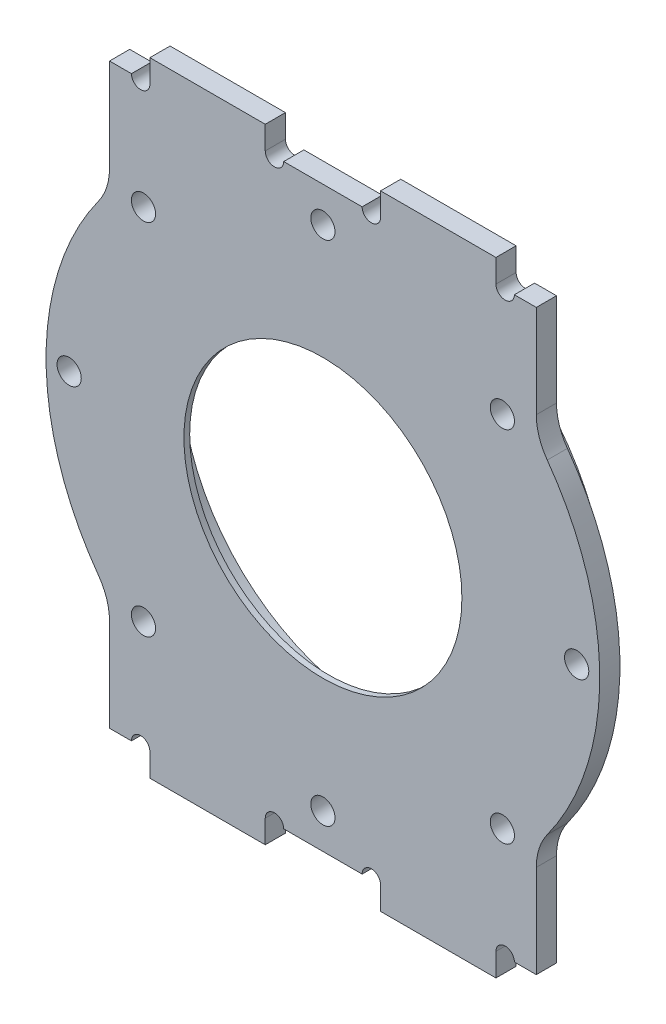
ISO-10303-21;
HEADER;
FILE_DESCRIPTION(('STEP AP214'),'2;1');
FILE_NAME('part.step','',(''),(''),'','','');
FILE_SCHEMA(('AUTOMOTIVE_DESIGN { 1 0 10303 214 1 1 1 1 }'));
ENDSEC;
DATA;
#1=APPLICATION_CONTEXT('core data for automotive mechanical design processes');
#2=APPLICATION_PROTOCOL_DEFINITION('international standard','automotive_design',2000,#1);
#3=PRODUCT_CONTEXT('',#1,'mechanical');
#4=PRODUCT('Part','Part','',(#3));
#5=PRODUCT_RELATED_PRODUCT_CATEGORY('part','',(#4));
#6=PRODUCT_DEFINITION_FORMATION('','',#4);
#7=PRODUCT_DEFINITION_CONTEXT('part definition',#1,'design');
#8=PRODUCT_DEFINITION('design','',#6,#7);
#9=PRODUCT_DEFINITION_SHAPE('','',#8);
#10=(LENGTH_UNIT() NAMED_UNIT(*) SI_UNIT(.MILLI.,.METRE.));
#11=(NAMED_UNIT(*) PLANE_ANGLE_UNIT() SI_UNIT($,.RADIAN.));
#12=(NAMED_UNIT(*) SI_UNIT($,.STERADIAN.) SOLID_ANGLE_UNIT());
#13=UNCERTAINTY_MEASURE_WITH_UNIT(LENGTH_MEASURE(1.E-05),#10,'distance_accuracy_value','');
#14=(GEOMETRIC_REPRESENTATION_CONTEXT(3) GLOBAL_UNCERTAINTY_ASSIGNED_CONTEXT((#13)) GLOBAL_UNIT_ASSIGNED_CONTEXT((#10,
#11,#12)) REPRESENTATION_CONTEXT('',''));
#15=CARTESIAN_POINT('',(0.,0.,0.));
#16=DIRECTION('',(0.,0.,1.));
#17=DIRECTION('',(1.,0.,0.));
#18=AXIS2_PLACEMENT_3D('',#15,#16,#17);
#19=CARTESIAN_POINT('',(-47.,33.9852909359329,3.5));
#20=DIRECTION('',(0.,0.,-1.));
#21=DIRECTION('',(-1.,0.,0.));
#22=AXIS2_PLACEMENT_3D('',#19,#20,#21);
#23=CYLINDRICAL_SURFACE('',#22,10.);
#24=CARTESIAN_POINT('',(-47.,33.9852909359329,3.5));
#25=DIRECTION('',(0.,0.,-1.));
#26=DIRECTION('',(1.,0.,0.));
#27=AXIS2_PLACEMENT_3D('',#24,#25,#26);
#28=CIRCLE('',#27,10.);
#29=CARTESIAN_POINT('',(-37.,33.9852909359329,3.5));
#30=VERTEX_POINT('',#29);
#31=CARTESIAN_POINT('',(-38.8965517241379,28.1257580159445,3.5));
#32=VERTEX_POINT('',#31);
#33=EDGE_CURVE('E478',#30,#32,#28,.T.);
#34=ORIENTED_EDGE('',*,*,#33,.F.);
#35=DIRECTION('',(0.,0.,1.));
#36=VECTOR('',#35,1.);
#37=CARTESIAN_POINT('',(-37.,33.9852909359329,0.));
#38=LINE('',#37,#36);
#39=CARTESIAN_POINT('',(-37.,33.9852909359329,0.));
#40=VERTEX_POINT('',#39);
#41=EDGE_CURVE('E501',#40,#30,#38,.T.);
#42=ORIENTED_EDGE('',*,*,#41,.F.);
#43=CARTESIAN_POINT('',(-47.,33.9852909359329,0.));
#44=DIRECTION('',(0.,0.,1.));
#45=DIRECTION('',(1.,0.,0.));
#46=AXIS2_PLACEMENT_3D('',#43,#44,#45);
#47=CIRCLE('',#46,10.);
#48=CARTESIAN_POINT('',(-38.8965517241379,28.1257580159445,0.));
#49=VERTEX_POINT('',#48);
#50=EDGE_CURVE('E677',#49,#40,#47,.T.);
#51=ORIENTED_EDGE('',*,*,#50,.F.);
#52=DIRECTION('',(0.,0.,-1.));
#53=VECTOR('',#52,1.);
#54=CARTESIAN_POINT('',(-38.8965517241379,28.1257580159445,3.5));
#55=LINE('',#54,#53);
#56=EDGE_CURVE('E487',#32,#49,#55,.T.);
#57=ORIENTED_EDGE('',*,*,#56,.F.);
#58=EDGE_LOOP('',(#34,#42,#51,#57));
#59=FACE_BOUND('',#58,.T.);
#60=ADVANCED_FACE('F17',(#59),#23,.F.);
#61=CARTESIAN_POINT('',(-47.,-33.9852909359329,3.5));
#62=DIRECTION('',(0.,0.,-1.));
#63=DIRECTION('',(-1.,0.,0.));
#64=AXIS2_PLACEMENT_3D('',#61,#62,#63);
#65=CYLINDRICAL_SURFACE('',#64,10.);
#66=CARTESIAN_POINT('',(-47.,-33.9852909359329,0.));
#67=DIRECTION('',(0.,0.,1.));
#68=DIRECTION('',(1.,0.,0.));
#69=AXIS2_PLACEMENT_3D('',#66,#67,#68);
#70=CIRCLE('',#69,10.);
#71=CARTESIAN_POINT('',(-37.,-33.9852909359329,0.));
#72=VERTEX_POINT('',#71);
#73=CARTESIAN_POINT('',(-38.8965517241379,-28.1257580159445,0.));
#74=VERTEX_POINT('',#73);
#75=EDGE_CURVE('E674',#72,#74,#70,.T.);
#76=ORIENTED_EDGE('',*,*,#75,.F.);
#77=DIRECTION('',(0.,0.,-1.));
#78=VECTOR('',#77,1.);
#79=CARTESIAN_POINT('',(-37.,-33.9852909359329,0.));
#80=LINE('',#79,#78);
#81=CARTESIAN_POINT('',(-37.,-33.9852909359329,3.5));
#82=VERTEX_POINT('',#81);
#83=EDGE_CURVE('E39',#82,#72,#80,.T.);
#84=ORIENTED_EDGE('',*,*,#83,.F.);
#85=CARTESIAN_POINT('',(-47.,-33.9852909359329,3.5));
#86=DIRECTION('',(0.,0.,-1.));
#87=DIRECTION('',(1.,0.,0.));
#88=AXIS2_PLACEMENT_3D('',#85,#86,#87);
#89=CIRCLE('',#88,10.);
#90=CARTESIAN_POINT('',(-38.8965517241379,-28.1257580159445,3.5));
#91=VERTEX_POINT('',#90);
#92=EDGE_CURVE('E482',#91,#82,#89,.T.);
#93=ORIENTED_EDGE('',*,*,#92,.F.);
#94=DIRECTION('',(0.,0.,1.));
#95=VECTOR('',#94,1.);
#96=CARTESIAN_POINT('',(-38.8965517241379,-28.1257580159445,3.5));
#97=LINE('',#96,#95);
#98=EDGE_CURVE('E600',#74,#91,#97,.T.);
#99=ORIENTED_EDGE('',*,*,#98,.F.);
#100=EDGE_LOOP('',(#76,#84,#93,#99));
#101=FACE_BOUND('',#100,.T.);
#102=ADVANCED_FACE('F998',(#101),#65,.F.);
#103=CARTESIAN_POINT('',(47.,-33.9852909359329,3.5));
#104=DIRECTION('',(0.,0.,-1.));
#105=DIRECTION('',(-1.,0.,0.));
#106=AXIS2_PLACEMENT_3D('',#103,#104,#105);
#107=CYLINDRICAL_SURFACE('',#106,10.);
#108=CARTESIAN_POINT('',(47.,-33.9852909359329,0.));
#109=DIRECTION('',(0.,0.,1.));
#110=DIRECTION('',(1.,0.,0.));
#111=AXIS2_PLACEMENT_3D('',#108,#109,#110);
#112=CIRCLE('',#111,10.);
#113=CARTESIAN_POINT('',(38.8965517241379,-28.1257580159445,0.));
#114=VERTEX_POINT('',#113);
#115=CARTESIAN_POINT('',(37.,-33.9852909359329,0.));
#116=VERTEX_POINT('',#115);
#117=EDGE_CURVE('E639',#114,#116,#112,.T.);
#118=ORIENTED_EDGE('',*,*,#117,.F.);
#119=DIRECTION('',(0.,0.,-1.));
#120=VECTOR('',#119,1.);
#121=CARTESIAN_POINT('',(38.8965517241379,-28.1257580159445,3.5));
#122=LINE('',#121,#120);
#123=CARTESIAN_POINT('',(38.8965517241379,-28.1257580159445,3.5));
#124=VERTEX_POINT('',#123);
#125=EDGE_CURVE('E345',#124,#114,#122,.T.);
#126=ORIENTED_EDGE('',*,*,#125,.F.);
#127=CARTESIAN_POINT('',(47.,-33.9852909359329,3.5));
#128=DIRECTION('',(0.,0.,-1.));
#129=DIRECTION('',(1.,0.,0.));
#130=AXIS2_PLACEMENT_3D('',#127,#128,#129);
#131=CIRCLE('',#130,10.);
#132=CARTESIAN_POINT('',(37.,-33.9852909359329,3.5));
#133=VERTEX_POINT('',#132);
#134=EDGE_CURVE('E435',#133,#124,#131,.T.);
#135=ORIENTED_EDGE('',*,*,#134,.F.);
#136=DIRECTION('',(0.,0.,1.));
#137=VECTOR('',#136,1.);
#138=CARTESIAN_POINT('',(37.,-33.9852909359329,3.5));
#139=LINE('',#138,#137);
#140=EDGE_CURVE('E492',#116,#133,#139,.T.);
#141=ORIENTED_EDGE('',*,*,#140,.F.);
#142=EDGE_LOOP('',(#118,#126,#135,#141));
#143=FACE_BOUND('',#142,.T.);
#144=ADVANCED_FACE('F19',(#143),#107,.F.);
#145=CARTESIAN_POINT('',(47.,33.9852909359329,3.5));
#146=DIRECTION('',(0.,0.,-1.));
#147=DIRECTION('',(-1.,0.,0.));
#148=AXIS2_PLACEMENT_3D('',#145,#146,#147);
#149=CYLINDRICAL_SURFACE('',#148,10.);
#150=CARTESIAN_POINT('',(47.,33.9852909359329,3.5));
#151=DIRECTION('',(0.,0.,-1.));
#152=DIRECTION('',(1.,0.,0.));
#153=AXIS2_PLACEMENT_3D('',#150,#151,#152);
#154=CIRCLE('',#153,10.);
#155=CARTESIAN_POINT('',(38.8965517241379,28.1257580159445,3.5));
#156=VERTEX_POINT('',#155);
#157=CARTESIAN_POINT('',(37.,33.9852909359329,3.5));
#158=VERTEX_POINT('',#157);
#159=EDGE_CURVE('E438',#156,#158,#154,.T.);
#160=ORIENTED_EDGE('',*,*,#159,.F.);
#161=DIRECTION('',(0.,0.,1.));
#162=VECTOR('',#161,1.);
#163=CARTESIAN_POINT('',(38.8965517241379,28.1257580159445,3.5));
#164=LINE('',#163,#162);
#165=CARTESIAN_POINT('',(38.8965517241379,28.1257580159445,0.));
#166=VERTEX_POINT('',#165);
#167=EDGE_CURVE('E398',#166,#156,#164,.T.);
#168=ORIENTED_EDGE('',*,*,#167,.F.);
#169=CARTESIAN_POINT('',(47.,33.9852909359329,0.));
#170=DIRECTION('',(0.,0.,1.));
#171=DIRECTION('',(1.,0.,0.));
#172=AXIS2_PLACEMENT_3D('',#169,#170,#171);
#173=CIRCLE('',#172,10.);
#174=CARTESIAN_POINT('',(37.,33.9852909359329,0.));
#175=VERTEX_POINT('',#174);
#176=EDGE_CURVE('E640',#175,#166,#173,.T.);
#177=ORIENTED_EDGE('',*,*,#176,.F.);
#178=DIRECTION('',(0.,0.,-1.));
#179=VECTOR('',#178,1.);
#180=CARTESIAN_POINT('',(37.,33.9852909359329,0.));
#181=LINE('',#180,#179);
#182=EDGE_CURVE('E495',#158,#175,#181,.T.);
#183=ORIENTED_EDGE('',*,*,#182,.F.);
#184=EDGE_LOOP('',(#160,#168,#177,#183));
#185=FACE_BOUND('',#184,.T.);
#186=ADVANCED_FACE('F1083',(#185),#149,.F.);
#187=CARTESIAN_POINT('',(0.,0.,1.03));
#188=DIRECTION('',(0.,0.,-1.));
#189=DIRECTION('',(0.,-1.,0.));
#190=AXIS2_PLACEMENT_3D('',#187,#188,#189);
#191=PLANE('',#190);
#192=CARTESIAN_POINT('',(0.,0.,1.03));
#193=DIRECTION('',(0.,0.,-1.));
#194=DIRECTION('',(-1.,0.,0.));
#195=AXIS2_PLACEMENT_3D('',#192,#193,#194);
#196=CIRCLE('',#195,32.53);
#197=CARTESIAN_POINT('',(-32.53,0.,1.03));
#198=VERTEX_POINT('',#197);
#199=EDGE_CURVE('E943',#198,#198,#196,.T.);
#200=ORIENTED_EDGE('',*,*,#199,.F.);
#201=EDGE_LOOP('',(#200));
#202=FACE_BOUND('',#201,.T.);
#203=CARTESIAN_POINT('',(0.,0.,1.03));
#204=DIRECTION('',(0.,0.,-1.));
#205=DIRECTION('',(-1.,0.,0.));
#206=AXIS2_PLACEMENT_3D('',#203,#204,#205);
#207=CIRCLE('',#206,34.03);
#208=CARTESIAN_POINT('',(-34.03,0.,1.03));
#209=VERTEX_POINT('',#208);
#210=EDGE_CURVE('E829',#209,#209,#207,.T.);
#211=ORIENTED_EDGE('',*,*,#210,.T.);
#212=EDGE_LOOP('',(#211));
#213=FACE_BOUND('',#212,.T.);
#214=ADVANCED_FACE('F1080',(#202,#213),#191,.T.);
#215=CARTESIAN_POINT('',(34.1835427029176,14.1592869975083,-2.));
#216=DIRECTION('',(0.,0.,-1.));
#217=DIRECTION('',(0.,-1.,0.));
#218=AXIS2_PLACEMENT_3D('',#215,#216,#217);
#219=PLANE('',#218);
#220=CARTESIAN_POINT('',(34.1835427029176,14.1592869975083,-2.));
#221=DIRECTION('',(0.,0.,-1.));
#222=DIRECTION('',(-1.,0.,0.));
#223=AXIS2_PLACEMENT_3D('',#220,#221,#222);
#224=CIRCLE('',#223,1.25);
#225=CARTESIAN_POINT('',(32.9335427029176,14.1592869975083,-2.));
#226=VERTEX_POINT('',#225);
#227=EDGE_CURVE('E778',#226,#226,#224,.T.);
#228=ORIENTED_EDGE('',*,*,#227,.T.);
#229=EDGE_LOOP('',(#228));
#230=FACE_BOUND('',#229,.T.);
#231=ADVANCED_FACE('F1055',(#230),#219,.T.);
#232=CARTESIAN_POINT('',(34.1835427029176,-14.1592869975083,-2.));
#233=DIRECTION('',(0.,0.,-1.));
#234=DIRECTION('',(0.,-1.,0.));
#235=AXIS2_PLACEMENT_3D('',#232,#233,#234);
#236=PLANE('',#235);
#237=CARTESIAN_POINT('',(34.1835427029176,-14.1592869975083,-2.));
#238=DIRECTION('',(0.,0.,-1.));
#239=DIRECTION('',(-1.,0.,0.));
#240=AXIS2_PLACEMENT_3D('',#237,#238,#239);
#241=CIRCLE('',#240,1.25);
#242=CARTESIAN_POINT('',(32.9335427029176,-14.1592869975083,-2.));
#243=VERTEX_POINT('',#242);
#244=EDGE_CURVE('E794',#243,#243,#241,.T.);
#245=ORIENTED_EDGE('',*,*,#244,.T.);
#246=EDGE_LOOP('',(#245));
#247=FACE_BOUND('',#246,.T.);
#248=ADVANCED_FACE('F1051',(#247),#236,.T.);
#249=CARTESIAN_POINT('',(14.1592869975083,-34.1835427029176,-2.));
#250=DIRECTION('',(0.,0.,-1.));
#251=DIRECTION('',(0.,-1.,0.));
#252=AXIS2_PLACEMENT_3D('',#249,#250,#251);
#253=PLANE('',#252);
#254=CARTESIAN_POINT('',(14.1592869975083,-34.1835427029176,-2.));
#255=DIRECTION('',(0.,0.,-1.));
#256=DIRECTION('',(-1.,0.,0.));
#257=AXIS2_PLACEMENT_3D('',#254,#255,#256);
#258=CIRCLE('',#257,1.25);
#259=CARTESIAN_POINT('',(12.9092869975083,-34.1835427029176,-2.));
#260=VERTEX_POINT('',#259);
#261=EDGE_CURVE('E774',#260,#260,#258,.T.);
#262=ORIENTED_EDGE('',*,*,#261,.T.);
#263=EDGE_LOOP('',(#262));
#264=FACE_BOUND('',#263,.T.);
#265=ADVANCED_FACE('F1054',(#264),#253,.T.);
#266=CARTESIAN_POINT('',(-14.1592869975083,-34.1835427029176,-2.));
#267=DIRECTION('',(0.,0.,-1.));
#268=DIRECTION('',(0.,-1.,0.));
#269=AXIS2_PLACEMENT_3D('',#266,#267,#268);
#270=PLANE('',#269);
#271=CARTESIAN_POINT('',(-14.1592869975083,-34.1835427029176,-2.));
#272=DIRECTION('',(0.,0.,-1.));
#273=DIRECTION('',(-1.,0.,0.));
#274=AXIS2_PLACEMENT_3D('',#271,#272,#273);
#275=CIRCLE('',#274,1.25);
#276=CARTESIAN_POINT('',(-15.4092869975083,-34.1835427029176,-2.));
#277=VERTEX_POINT('',#276);
#278=EDGE_CURVE('E773',#277,#277,#275,.T.);
#279=ORIENTED_EDGE('',*,*,#278,.T.);
#280=EDGE_LOOP('',(#279));
#281=FACE_BOUND('',#280,.T.);
#282=ADVANCED_FACE('F1151',(#281),#270,.T.);
#283=CARTESIAN_POINT('',(-34.1835427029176,-14.1592869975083,-2.));
#284=DIRECTION('',(0.,0.,-1.));
#285=DIRECTION('',(0.,-1.,0.));
#286=AXIS2_PLACEMENT_3D('',#283,#284,#285);
#287=PLANE('',#286);
#288=CARTESIAN_POINT('',(-34.1835427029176,-14.1592869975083,-2.));
#289=DIRECTION('',(0.,0.,-1.));
#290=DIRECTION('',(-1.,0.,0.));
#291=AXIS2_PLACEMENT_3D('',#288,#289,#290);
#292=CIRCLE('',#291,1.25);
#293=CARTESIAN_POINT('',(-35.4335427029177,-14.1592869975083,-2.));
#294=VERTEX_POINT('',#293);
#295=EDGE_CURVE('E808',#294,#294,#292,.T.);
#296=ORIENTED_EDGE('',*,*,#295,.T.);
#297=EDGE_LOOP('',(#296));
#298=FACE_BOUND('',#297,.T.);
#299=ADVANCED_FACE('F1149',(#298),#287,.T.);
#300=CARTESIAN_POINT('',(-34.1835427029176,14.1592869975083,-2.));
#301=DIRECTION('',(0.,0.,-1.));
#302=DIRECTION('',(0.,-1.,0.));
#303=AXIS2_PLACEMENT_3D('',#300,#301,#302);
#304=PLANE('',#303);
#305=CARTESIAN_POINT('',(-34.1835427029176,14.1592869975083,-2.));
#306=DIRECTION('',(0.,0.,-1.));
#307=DIRECTION('',(-1.,0.,0.));
#308=AXIS2_PLACEMENT_3D('',#305,#306,#307);
#309=CIRCLE('',#308,1.25);
#310=CARTESIAN_POINT('',(-35.4335427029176,14.1592869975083,-2.));
#311=VERTEX_POINT('',#310);
#312=EDGE_CURVE('E807',#311,#311,#309,.T.);
#313=ORIENTED_EDGE('',*,*,#312,.T.);
#314=EDGE_LOOP('',(#313));
#315=FACE_BOUND('',#314,.T.);
#316=ADVANCED_FACE('F1145',(#315),#304,.T.);
#317=CARTESIAN_POINT('',(-14.1592869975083,34.1835427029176,-2.));
#318=DIRECTION('',(0.,0.,-1.));
#319=DIRECTION('',(0.,-1.,0.));
#320=AXIS2_PLACEMENT_3D('',#317,#318,#319);
#321=PLANE('',#320);
#322=CARTESIAN_POINT('',(-14.1592869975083,34.1835427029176,-2.));
#323=DIRECTION('',(0.,0.,-1.));
#324=DIRECTION('',(-1.,0.,0.));
#325=AXIS2_PLACEMENT_3D('',#322,#323,#324);
#326=CIRCLE('',#325,1.25);
#327=CARTESIAN_POINT('',(-15.4092869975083,34.1835427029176,-2.));
#328=VERTEX_POINT('',#327);
#329=EDGE_CURVE('E806',#328,#328,#326,.T.);
#330=ORIENTED_EDGE('',*,*,#329,.T.);
#331=EDGE_LOOP('',(#330));
#332=FACE_BOUND('',#331,.T.);
#333=ADVANCED_FACE('F1141',(#332),#321,.T.);
#334=CARTESIAN_POINT('',(14.1592869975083,34.1835427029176,-2.));
#335=DIRECTION('',(0.,0.,-1.));
#336=DIRECTION('',(0.,-1.,0.));
#337=AXIS2_PLACEMENT_3D('',#334,#335,#336);
#338=PLANE('',#337);
#339=CARTESIAN_POINT('',(14.1592869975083,34.1835427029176,-2.));
#340=DIRECTION('',(0.,0.,-1.));
#341=DIRECTION('',(-1.,0.,0.));
#342=AXIS2_PLACEMENT_3D('',#339,#340,#341);
#343=CIRCLE('',#342,1.25);
#344=CARTESIAN_POINT('',(12.9092869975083,34.1835427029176,-2.));
#345=VERTEX_POINT('',#344);
#346=EDGE_CURVE('E813',#345,#345,#343,.T.);
#347=ORIENTED_EDGE('',*,*,#346,.T.);
#348=EDGE_LOOP('',(#347));
#349=FACE_BOUND('',#348,.T.);
#350=ADVANCED_FACE('F967',(#349),#338,.T.);
#351=CARTESIAN_POINT('',(0.,0.,-6.));
#352=DIRECTION('',(0.,0.,-1.));
#353=DIRECTION('',(0.,-1.,0.));
#354=AXIS2_PLACEMENT_3D('',#351,#352,#353);
#355=PLANE('',#354);
#356=CARTESIAN_POINT('',(0.,0.,-6.));
#357=DIRECTION('',(0.,0.,-1.));
#358=DIRECTION('',(-1.,0.,0.));
#359=AXIS2_PLACEMENT_3D('',#356,#357,#358);
#360=CIRCLE('',#359,34.03);
#361=CARTESIAN_POINT('',(-34.03,0.,-6.));
#362=VERTEX_POINT('',#361);
#363=EDGE_CURVE('E825',#362,#362,#360,.T.);
#364=ORIENTED_EDGE('',*,*,#363,.F.);
#365=EDGE_LOOP('',(#364));
#366=FACE_BOUND('',#365,.T.);
#367=CARTESIAN_POINT('',(14.1592869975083,34.1835427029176,-6.));
#368=DIRECTION('',(0.,0.,-1.));
#369=DIRECTION('',(-1.,0.,0.));
#370=AXIS2_PLACEMENT_3D('',#367,#368,#369);
#371=CIRCLE('',#370,1.25);
#372=CARTESIAN_POINT('',(12.9092869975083,34.1835427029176,-6.));
#373=VERTEX_POINT('',#372);
#374=EDGE_CURVE('E817',#373,#373,#371,.T.);
#375=ORIENTED_EDGE('',*,*,#374,.F.);
#376=EDGE_LOOP('',(#375));
#377=FACE_BOUND('',#376,.T.);
#378=CARTESIAN_POINT('',(-14.1592869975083,34.1835427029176,-6.));
#379=DIRECTION('',(0.,0.,-1.));
#380=DIRECTION('',(-1.,0.,0.));
#381=AXIS2_PLACEMENT_3D('',#378,#379,#380);
#382=CIRCLE('',#381,1.25);
#383=CARTESIAN_POINT('',(-15.4092869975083,34.1835427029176,-6.));
#384=VERTEX_POINT('',#383);
#385=EDGE_CURVE('E818',#384,#384,#382,.T.);
#386=ORIENTED_EDGE('',*,*,#385,.F.);
#387=EDGE_LOOP('',(#386));
#388=FACE_BOUND('',#387,.T.);
#389=CARTESIAN_POINT('',(-34.1835427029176,14.1592869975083,-6.));
#390=DIRECTION('',(0.,0.,-1.));
#391=DIRECTION('',(-1.,0.,0.));
#392=AXIS2_PLACEMENT_3D('',#389,#390,#391);
#393=CIRCLE('',#392,1.25);
#394=CARTESIAN_POINT('',(-35.4335427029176,14.1592869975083,-6.));
#395=VERTEX_POINT('',#394);
#396=EDGE_CURVE('E802',#395,#395,#393,.T.);
#397=ORIENTED_EDGE('',*,*,#396,.F.);
#398=EDGE_LOOP('',(#397));
#399=FACE_BOUND('',#398,.T.);
#400=CARTESIAN_POINT('',(-34.1835427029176,-14.1592869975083,-6.));
#401=DIRECTION('',(0.,0.,-1.));
#402=DIRECTION('',(-1.,0.,0.));
#403=AXIS2_PLACEMENT_3D('',#400,#401,#402);
#404=CIRCLE('',#403,1.25);
#405=CARTESIAN_POINT('',(-35.4335427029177,-14.1592869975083,-6.));
#406=VERTEX_POINT('',#405);
#407=EDGE_CURVE('E812',#406,#406,#404,.T.);
#408=ORIENTED_EDGE('',*,*,#407,.F.);
#409=EDGE_LOOP('',(#408));
#410=FACE_BOUND('',#409,.T.);
#411=CARTESIAN_POINT('',(-14.1592869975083,-34.1835427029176,-6.));
#412=DIRECTION('',(0.,0.,-1.));
#413=DIRECTION('',(-1.,0.,0.));
#414=AXIS2_PLACEMENT_3D('',#411,#412,#413);
#415=CIRCLE('',#414,1.25);
#416=CARTESIAN_POINT('',(-15.4092869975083,-34.1835427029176,-6.));
#417=VERTEX_POINT('',#416);
#418=EDGE_CURVE('E801',#417,#417,#415,.T.);
#419=ORIENTED_EDGE('',*,*,#418,.F.);
#420=EDGE_LOOP('',(#419));
#421=FACE_BOUND('',#420,.T.);
#422=CARTESIAN_POINT('',(14.1592869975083,-34.1835427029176,-6.));
#423=DIRECTION('',(0.,0.,-1.));
#424=DIRECTION('',(-1.,0.,0.));
#425=AXIS2_PLACEMENT_3D('',#422,#423,#424);
#426=CIRCLE('',#425,1.25);
#427=CARTESIAN_POINT('',(12.9092869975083,-34.1835427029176,-6.));
#428=VERTEX_POINT('',#427);
#429=EDGE_CURVE('E769',#428,#428,#426,.T.);
#430=ORIENTED_EDGE('',*,*,#429,.F.);
#431=EDGE_LOOP('',(#430));
#432=FACE_BOUND('',#431,.T.);
#433=CARTESIAN_POINT('',(34.1835427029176,-14.1592869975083,-6.));
#434=DIRECTION('',(0.,0.,-1.));
#435=DIRECTION('',(-1.,0.,0.));
#436=AXIS2_PLACEMENT_3D('',#433,#434,#435);
#437=CIRCLE('',#436,1.25);
#438=CARTESIAN_POINT('',(32.9335427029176,-14.1592869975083,-6.));
#439=VERTEX_POINT('',#438);
#440=EDGE_CURVE('E786',#439,#439,#437,.T.);
#441=ORIENTED_EDGE('',*,*,#440,.F.);
#442=EDGE_LOOP('',(#441));
#443=FACE_BOUND('',#442,.T.);
#444=CARTESIAN_POINT('',(34.1835427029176,14.1592869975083,-6.));
#445=DIRECTION('',(0.,0.,-1.));
#446=DIRECTION('',(-1.,0.,0.));
#447=AXIS2_PLACEMENT_3D('',#444,#445,#446);
#448=CIRCLE('',#447,1.25);
#449=CARTESIAN_POINT('',(32.9335427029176,14.1592869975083,-6.));
#450=VERTEX_POINT('',#449);
#451=EDGE_CURVE('E782',#450,#450,#448,.T.);
#452=ORIENTED_EDGE('',*,*,#451,.F.);
#453=EDGE_LOOP('',(#452));
#454=FACE_BOUND('',#453,.T.);
#455=CARTESIAN_POINT('',(0.,0.,-6.));
#456=DIRECTION('',(0.,0.,-1.));
#457=DIRECTION('',(-1.,0.,0.));
#458=AXIS2_PLACEMENT_3D('',#455,#456,#457);
#459=CIRCLE('',#458,40.03);
#460=CARTESIAN_POINT('',(-40.03,0.,-6.));
#461=VERTEX_POINT('',#460);
#462=EDGE_CURVE('E862',#461,#461,#459,.T.);
#463=ORIENTED_EDGE('',*,*,#462,.T.);
#464=EDGE_LOOP('',(#463));
#465=FACE_BOUND('',#464,.T.);
#466=ADVANCED_FACE('F964',(#366,#377,#388,#399,#410,#421,#432,#443,#454,#465),#355,.T.);
#467=CARTESIAN_POINT('',(-31.6,-50.1,-10.5));
#468=DIRECTION('',(0.,0.,1.));
#469=DIRECTION('',(1.,0.,0.));
#470=AXIS2_PLACEMENT_3D('',#467,#468,#469);
#471=CYLINDRICAL_SURFACE('',#470,1.6);
#472=CARTESIAN_POINT('',(-31.6,-50.1,0.));
#473=DIRECTION('',(0.,0.,-1.));
#474=DIRECTION('',(1.,0.,0.));
#475=AXIS2_PLACEMENT_3D('',#472,#473,#474);
#476=CIRCLE('',#475,1.6);
#477=CARTESIAN_POINT('',(-33.2,-50.1,0.));
#478=VERTEX_POINT('',#477);
#479=CARTESIAN_POINT('',(-30.,-50.1,0.));
#480=VERTEX_POINT('',#479);
#481=EDGE_CURVE('E592',#478,#480,#476,.T.);
#482=ORIENTED_EDGE('',*,*,#481,.T.);
#483=DIRECTION('',(0.,0.,1.));
#484=VECTOR('',#483,1.);
#485=CARTESIAN_POINT('',(-30.,-50.1,0.));
#486=LINE('',#485,#484);
#487=CARTESIAN_POINT('',(-30.,-50.1,3.5));
#488=VERTEX_POINT('',#487);
#489=EDGE_CURVE('E339',#480,#488,#486,.T.);
#490=ORIENTED_EDGE('',*,*,#489,.T.);
#491=CARTESIAN_POINT('',(-31.6,-50.1,3.5));
#492=DIRECTION('',(0.,0.,-1.));
#493=DIRECTION('',(1.,0.,0.));
#494=AXIS2_PLACEMENT_3D('',#491,#492,#493);
#495=CIRCLE('',#494,1.6);
#496=CARTESIAN_POINT('',(-33.2,-50.1,3.5));
#497=VERTEX_POINT('',#496);
#498=EDGE_CURVE('E332',#497,#488,#495,.T.);
#499=ORIENTED_EDGE('',*,*,#498,.F.);
#500=DIRECTION('',(0.,0.,1.));
#501=VECTOR('',#500,1.);
#502=CARTESIAN_POINT('',(-33.2,-50.1,-10.5));
#503=LINE('',#502,#501);
#504=EDGE_CURVE('E337',#478,#497,#503,.T.);
#505=ORIENTED_EDGE('',*,*,#504,.F.);
#506=EDGE_LOOP('',(#482,#490,#499,#505));
#507=FACE_BOUND('',#506,.T.);
#508=ADVANCED_FACE('F335',(#507),#471,.F.);
#509=CARTESIAN_POINT('',(-8.4,-50.1,-10.5));
#510=DIRECTION('',(0.,0.,1.));
#511=DIRECTION('',(1.,0.,0.));
#512=AXIS2_PLACEMENT_3D('',#509,#510,#511);
#513=CYLINDRICAL_SURFACE('',#512,1.6);
#514=CARTESIAN_POINT('',(-8.4,-50.1,3.5));
#515=DIRECTION('',(0.,0.,-1.));
#516=DIRECTION('',(1.,0.,0.));
#517=AXIS2_PLACEMENT_3D('',#514,#515,#516);
#518=CIRCLE('',#517,1.6);
#519=CARTESIAN_POINT('',(-10.,-50.1,3.5));
#520=VERTEX_POINT('',#519);
#521=CARTESIAN_POINT('',(-6.8,-50.1,3.5));
#522=VERTEX_POINT('',#521);
#523=EDGE_CURVE('E413',#520,#522,#518,.T.);
#524=ORIENTED_EDGE('',*,*,#523,.F.);
#525=DIRECTION('',(0.,0.,1.));
#526=VECTOR('',#525,1.);
#527=CARTESIAN_POINT('',(-10.,-50.1,0.));
#528=LINE('',#527,#526);
#529=CARTESIAN_POINT('',(-10.,-50.1,0.));
#530=VERTEX_POINT('',#529);
#531=EDGE_CURVE('E537',#530,#520,#528,.T.);
#532=ORIENTED_EDGE('',*,*,#531,.F.);
#533=CARTESIAN_POINT('',(-8.4,-50.1,0.));
#534=DIRECTION('',(0.,0.,-1.));
#535=DIRECTION('',(1.,0.,0.));
#536=AXIS2_PLACEMENT_3D('',#533,#534,#535);
#537=CIRCLE('',#536,1.6);
#538=CARTESIAN_POINT('',(-6.8,-50.1,0.));
#539=VERTEX_POINT('',#538);
#540=EDGE_CURVE('E670',#530,#539,#537,.T.);
#541=ORIENTED_EDGE('',*,*,#540,.T.);
#542=DIRECTION('',(0.,0.,-1.));
#543=VECTOR('',#542,1.);
#544=CARTESIAN_POINT('',(-6.8,-50.1,-10.5));
#545=LINE('',#544,#543);
#546=EDGE_CURVE('E369',#522,#539,#545,.T.);
#547=ORIENTED_EDGE('',*,*,#546,.F.);
#548=EDGE_LOOP('',(#524,#532,#541,#547));
#549=FACE_BOUND('',#548,.T.);
#550=ADVANCED_FACE('F1025',(#549),#513,.F.);
#551=CARTESIAN_POINT('',(31.6,-50.1,-10.5));
#552=DIRECTION('',(0.,0.,1.));
#553=DIRECTION('',(1.,0.,0.));
#554=AXIS2_PLACEMENT_3D('',#551,#552,#553);
#555=CYLINDRICAL_SURFACE('',#554,1.6);
#556=CARTESIAN_POINT('',(31.6,-50.1,3.5));
#557=DIRECTION('',(0.,0.,-1.));
#558=DIRECTION('',(1.,0.,0.));
#559=AXIS2_PLACEMENT_3D('',#556,#557,#558);
#560=CIRCLE('',#559,1.6);
#561=CARTESIAN_POINT('',(30.,-50.1,3.5));
#562=VERTEX_POINT('',#561);
#563=CARTESIAN_POINT('',(33.2,-50.1,3.5));
#564=VERTEX_POINT('',#563);
#565=EDGE_CURVE('E429',#562,#564,#560,.T.);
#566=ORIENTED_EDGE('',*,*,#565,.F.);
#567=DIRECTION('',(0.,0.,1.));
#568=VECTOR('',#567,1.);
#569=CARTESIAN_POINT('',(30.,-50.1,0.));
#570=LINE('',#569,#568);
#571=CARTESIAN_POINT('',(30.,-50.1,0.));
#572=VERTEX_POINT('',#571);
#573=EDGE_CURVE('E543',#572,#562,#570,.T.);
#574=ORIENTED_EDGE('',*,*,#573,.F.);
#575=CARTESIAN_POINT('',(31.6,-50.1,0.));
#576=DIRECTION('',(0.,0.,-1.));
#577=DIRECTION('',(1.,0.,0.));
#578=AXIS2_PLACEMENT_3D('',#575,#576,#577);
#579=CIRCLE('',#578,1.6);
#580=CARTESIAN_POINT('',(33.2,-50.1,0.));
#581=VERTEX_POINT('',#580);
#582=EDGE_CURVE('E719',#572,#581,#579,.T.);
#583=ORIENTED_EDGE('',*,*,#582,.T.);
#584=DIRECTION('',(0.,0.,-1.));
#585=VECTOR('',#584,1.);
#586=CARTESIAN_POINT('',(33.2,-50.1,-10.5));
#587=LINE('',#586,#585);
#588=EDGE_CURVE('E744',#564,#581,#587,.T.);
#589=ORIENTED_EDGE('',*,*,#588,.F.);
#590=EDGE_LOOP('',(#566,#574,#583,#589));
#591=FACE_BOUND('',#590,.T.);
#592=ADVANCED_FACE('F1021',(#591),#555,.F.);
#593=CARTESIAN_POINT('',(8.4,-50.1,-10.5));
#594=DIRECTION('',(0.,0.,1.));
#595=DIRECTION('',(1.,0.,0.));
#596=AXIS2_PLACEMENT_3D('',#593,#594,#595);
#597=CYLINDRICAL_SURFACE('',#596,1.6);
#598=CARTESIAN_POINT('',(8.4,-50.1,0.));
#599=DIRECTION('',(0.,0.,-1.));
#600=DIRECTION('',(1.,0.,0.));
#601=AXIS2_PLACEMENT_3D('',#598,#599,#600);
#602=CIRCLE('',#601,1.6);
#603=CARTESIAN_POINT('',(6.8,-50.1,0.));
#604=VERTEX_POINT('',#603);
#605=CARTESIAN_POINT('',(10.,-50.1,0.));
#606=VERTEX_POINT('',#605);
#607=EDGE_CURVE('E612',#604,#606,#602,.T.);
#608=ORIENTED_EDGE('',*,*,#607,.T.);
#609=DIRECTION('',(0.,0.,1.));
#610=VECTOR('',#609,1.);
#611=CARTESIAN_POINT('',(10.,-50.1,0.));
#612=LINE('',#611,#610);
#613=CARTESIAN_POINT('',(10.,-50.1,3.5));
#614=VERTEX_POINT('',#613);
#615=EDGE_CURVE('E11',#606,#614,#612,.T.);
#616=ORIENTED_EDGE('',*,*,#615,.T.);
#617=CARTESIAN_POINT('',(8.4,-50.1,3.5));
#618=DIRECTION('',(0.,0.,-1.));
#619=DIRECTION('',(1.,0.,0.));
#620=AXIS2_PLACEMENT_3D('',#617,#618,#619);
#621=CIRCLE('',#620,1.6);
#622=CARTESIAN_POINT('',(6.8,-50.1,3.5));
#623=VERTEX_POINT('',#622);
#624=EDGE_CURVE('E416',#623,#614,#621,.T.);
#625=ORIENTED_EDGE('',*,*,#624,.F.);
#626=DIRECTION('',(0.,0.,1.));
#627=VECTOR('',#626,1.);
#628=CARTESIAN_POINT('',(6.8,-50.1,-10.5));
#629=LINE('',#628,#627);
#630=EDGE_CURVE('E362',#604,#623,#629,.T.);
#631=ORIENTED_EDGE('',*,*,#630,.F.);
#632=EDGE_LOOP('',(#608,#616,#625,#631));
#633=FACE_BOUND('',#632,.T.);
#634=ADVANCED_FACE('F1024',(#633),#597,.F.);
#635=CARTESIAN_POINT('',(10.,-50.1,0.));
#636=DIRECTION('',(1.,0.,0.));
#637=DIRECTION('',(0.,-1.,0.));
#638=AXIS2_PLACEMENT_3D('',#635,#636,#637);
#639=PLANE('',#638);
#640=DIRECTION('',(0.,1.,0.));
#641=VECTOR('',#640,1.);
#642=CARTESIAN_POINT('',(10.,-50.1,3.5));
#643=LINE('',#642,#641);
#644=CARTESIAN_POINT('',(10.,-54.1,3.5));
#645=VERTEX_POINT('',#644);
#646=EDGE_CURVE('E420',#645,#614,#643,.T.);
#647=ORIENTED_EDGE('',*,*,#646,.T.);
#648=ORIENTED_EDGE('',*,*,#615,.F.);
#649=DIRECTION('',(0.,1.,0.));
#650=VECTOR('',#649,1.);
#651=CARTESIAN_POINT('',(10.,-50.1,0.));
#652=LINE('',#651,#650);
#653=CARTESIAN_POINT('',(10.,-54.1,0.));
#654=VERTEX_POINT('',#653);
#655=EDGE_CURVE('E554',#654,#606,#652,.T.);
#656=ORIENTED_EDGE('',*,*,#655,.F.);
#657=DIRECTION('',(0.,0.,1.));
#658=VECTOR('',#657,1.);
#659=CARTESIAN_POINT('',(10.,-54.1,0.));
#660=LINE('',#659,#658);
#661=EDGE_CURVE('E26',#654,#645,#660,.T.);
#662=ORIENTED_EDGE('',*,*,#661,.T.);
#663=EDGE_LOOP('',(#647,#648,#656,#662));
#664=FACE_BOUND('',#663,.T.);
#665=ADVANCED_FACE('F551',(#664),#639,.F.);
#666=CARTESIAN_POINT('',(30.,-54.1,0.));
#667=DIRECTION('',(0.,1.,0.));
#668=DIRECTION('',(1.,0.,0.));
#669=AXIS2_PLACEMENT_3D('',#666,#667,#668);
#670=PLANE('',#669);
#671=DIRECTION('',(-1.,0.,0.));
#672=VECTOR('',#671,1.);
#673=CARTESIAN_POINT('',(30.,-54.1,3.5));
#674=LINE('',#673,#672);
#675=CARTESIAN_POINT('',(30.,-54.1,3.5));
#676=VERTEX_POINT('',#675);
#677=EDGE_CURVE('E421',#676,#645,#674,.T.);
#678=ORIENTED_EDGE('',*,*,#677,.T.);
#679=ORIENTED_EDGE('',*,*,#661,.F.);
#680=DIRECTION('',(-1.,0.,0.));
#681=VECTOR('',#680,1.);
#682=CARTESIAN_POINT('',(30.,-54.1,0.));
#683=LINE('',#682,#681);
#684=CARTESIAN_POINT('',(30.,-54.1,0.));
#685=VERTEX_POINT('',#684);
#686=EDGE_CURVE('E727',#685,#654,#683,.T.);
#687=ORIENTED_EDGE('',*,*,#686,.F.);
#688=DIRECTION('',(0.,0.,1.));
#689=VECTOR('',#688,1.);
#690=CARTESIAN_POINT('',(30.,-54.1,0.));
#691=LINE('',#690,#689);
#692=EDGE_CURVE('E540',#685,#676,#691,.T.);
#693=ORIENTED_EDGE('',*,*,#692,.T.);
#694=EDGE_LOOP('',(#678,#679,#687,#693));
#695=FACE_BOUND('',#694,.T.);
#696=ADVANCED_FACE('F559',(#695),#670,.F.);
#697=CARTESIAN_POINT('',(30.,-50.1,0.));
#698=DIRECTION('',(-1.,0.,0.));
#699=DIRECTION('',(0.,0.,1.));
#700=AXIS2_PLACEMENT_3D('',#697,#698,#699);
#701=PLANE('',#700);
#702=DIRECTION('',(0.,-1.,0.));
#703=VECTOR('',#702,1.);
#704=CARTESIAN_POINT('',(30.,-50.1,3.5));
#705=LINE('',#704,#703);
#706=EDGE_CURVE('E425',#562,#676,#705,.T.);
#707=ORIENTED_EDGE('',*,*,#706,.T.);
#708=ORIENTED_EDGE('',*,*,#692,.F.);
#709=DIRECTION('',(0.,-1.,0.));
#710=VECTOR('',#709,1.);
#711=CARTESIAN_POINT('',(30.,-50.1,0.));
#712=LINE('',#711,#710);
#713=EDGE_CURVE('E730',#572,#685,#712,.T.);
#714=ORIENTED_EDGE('',*,*,#713,.F.);
#715=ORIENTED_EDGE('',*,*,#573,.T.);
#716=EDGE_LOOP('',(#707,#708,#714,#715));
#717=FACE_BOUND('',#716,.T.);
#718=ADVANCED_FACE('F1124',(#717),#701,.F.);
#719=CARTESIAN_POINT('',(-30.,-54.1,0.));
#720=DIRECTION('',(0.,1.,0.));
#721=DIRECTION('',(1.,0.,0.));
#722=AXIS2_PLACEMENT_3D('',#719,#720,#721);
#723=PLANE('',#722);
#724=DIRECTION('',(-1.,0.,0.));
#725=VECTOR('',#724,1.);
#726=CARTESIAN_POINT('',(-30.,-54.1,3.5));
#727=LINE('',#726,#725);
#728=CARTESIAN_POINT('',(-10.,-54.1,3.5));
#729=VERTEX_POINT('',#728);
#730=CARTESIAN_POINT('',(-30.,-54.1,3.5));
#731=VERTEX_POINT('',#730);
#732=EDGE_CURVE('E408',#729,#731,#727,.T.);
#733=ORIENTED_EDGE('',*,*,#732,.T.);
#734=DIRECTION('',(0.,0.,1.));
#735=VECTOR('',#734,1.);
#736=CARTESIAN_POINT('',(-30.,-54.1,0.));
#737=LINE('',#736,#735);
#738=CARTESIAN_POINT('',(-30.,-54.1,0.));
#739=VERTEX_POINT('',#738);
#740=EDGE_CURVE('E531',#739,#731,#737,.T.);
#741=ORIENTED_EDGE('',*,*,#740,.F.);
#742=DIRECTION('',(-1.,0.,0.));
#743=VECTOR('',#742,1.);
#744=CARTESIAN_POINT('',(-30.,-54.1,0.));
#745=LINE('',#744,#743);
#746=CARTESIAN_POINT('',(-10.,-54.1,0.));
#747=VERTEX_POINT('',#746);
#748=EDGE_CURVE('E669',#747,#739,#745,.T.);
#749=ORIENTED_EDGE('',*,*,#748,.F.);
#750=DIRECTION('',(0.,0.,1.));
#751=VECTOR('',#750,1.);
#752=CARTESIAN_POINT('',(-10.,-54.1,0.));
#753=LINE('',#752,#751);
#754=EDGE_CURVE('E534',#747,#729,#753,.T.);
#755=ORIENTED_EDGE('',*,*,#754,.T.);
#756=EDGE_LOOP('',(#733,#741,#749,#755));
#757=FACE_BOUND('',#756,.T.);
#758=ADVANCED_FACE('F1120',(#757),#723,.F.);
#759=CARTESIAN_POINT('',(-10.,-50.1,0.));
#760=DIRECTION('',(-1.,0.,0.));
#761=DIRECTION('',(0.,1.,0.));
#762=AXIS2_PLACEMENT_3D('',#759,#760,#761);
#763=PLANE('',#762);
#764=DIRECTION('',(0.,-1.,0.));
#765=VECTOR('',#764,1.);
#766=CARTESIAN_POINT('',(-10.,-50.1,3.5));
#767=LINE('',#766,#765);
#768=EDGE_CURVE('E412',#520,#729,#767,.T.);
#769=ORIENTED_EDGE('',*,*,#768,.T.);
#770=ORIENTED_EDGE('',*,*,#754,.F.);
#771=DIRECTION('',(0.,-1.,0.));
#772=VECTOR('',#771,1.);
#773=CARTESIAN_POINT('',(-10.,-50.1,0.));
#774=LINE('',#773,#772);
#775=EDGE_CURVE('E665',#530,#747,#774,.T.);
#776=ORIENTED_EDGE('',*,*,#775,.F.);
#777=ORIENTED_EDGE('',*,*,#531,.T.);
#778=EDGE_LOOP('',(#769,#770,#776,#777));
#779=FACE_BOUND('',#778,.T.);
#780=ADVANCED_FACE('F1078',(#779),#763,.F.);
#781=CARTESIAN_POINT('',(-30.,-50.1,0.));
#782=DIRECTION('',(1.,0.,0.));
#783=DIRECTION('',(0.,1.,0.));
#784=AXIS2_PLACEMENT_3D('',#781,#782,#783);
#785=PLANE('',#784);
#786=DIRECTION('',(0.,1.,0.));
#787=VECTOR('',#786,1.);
#788=CARTESIAN_POINT('',(-30.,-50.1,3.5));
#789=LINE('',#788,#787);
#790=EDGE_CURVE('E344',#731,#488,#789,.T.);
#791=ORIENTED_EDGE('',*,*,#790,.T.);
#792=ORIENTED_EDGE('',*,*,#489,.F.);
#793=DIRECTION('',(0.,1.,0.));
#794=VECTOR('',#793,1.);
#795=CARTESIAN_POINT('',(-30.,-50.1,0.));
#796=LINE('',#795,#794);
#797=EDGE_CURVE('E739',#739,#480,#796,.T.);
#798=ORIENTED_EDGE('',*,*,#797,.F.);
#799=ORIENTED_EDGE('',*,*,#740,.T.);
#800=EDGE_LOOP('',(#791,#792,#798,#799));
#801=FACE_BOUND('',#800,.T.);
#802=ADVANCED_FACE('F1075',(#801),#785,.F.);
#803=CARTESIAN_POINT('',(-31.6,50.1,-10.5));
#804=DIRECTION('',(0.,0.,1.));
#805=DIRECTION('',(1.,0.,0.));
#806=AXIS2_PLACEMENT_3D('',#803,#804,#805);
#807=CYLINDRICAL_SURFACE('',#806,1.6);
#808=CARTESIAN_POINT('',(-31.6,50.1,3.5));
#809=DIRECTION('',(0.,0.,1.));
#810=DIRECTION('',(1.,0.,0.));
#811=AXIS2_PLACEMENT_3D('',#808,#809,#810);
#812=CIRCLE('',#811,1.6);
#813=CARTESIAN_POINT('',(-33.2,50.1,3.5));
#814=VERTEX_POINT('',#813);
#815=CARTESIAN_POINT('',(-30.,50.1,3.5));
#816=VERTEX_POINT('',#815);
#817=EDGE_CURVE('E470',#814,#816,#812,.T.);
#818=ORIENTED_EDGE('',*,*,#817,.T.);
#819=DIRECTION('',(0.,0.,1.));
#820=VECTOR('',#819,1.);
#821=CARTESIAN_POINT('',(-30.,50.1,0.));
#822=LINE('',#821,#820);
#823=CARTESIAN_POINT('',(-30.,50.1,0.));
#824=VERTEX_POINT('',#823);
#825=EDGE_CURVE('E510',#824,#816,#822,.T.);
#826=ORIENTED_EDGE('',*,*,#825,.F.);
#827=CARTESIAN_POINT('',(-31.6,50.1,0.));
#828=DIRECTION('',(0.,0.,1.));
#829=DIRECTION('',(1.,0.,0.));
#830=AXIS2_PLACEMENT_3D('',#827,#828,#829);
#831=CIRCLE('',#830,1.6);
#832=CARTESIAN_POINT('',(-33.2,50.1,0.));
#833=VERTEX_POINT('',#832);
#834=EDGE_CURVE('E690',#833,#824,#831,.T.);
#835=ORIENTED_EDGE('',*,*,#834,.F.);
#836=DIRECTION('',(0.,0.,-1.));
#837=VECTOR('',#836,1.);
#838=CARTESIAN_POINT('',(-33.2,50.1,-10.5));
#839=LINE('',#838,#837);
#840=EDGE_CURVE('E391',#814,#833,#839,.T.);
#841=ORIENTED_EDGE('',*,*,#840,.F.);
#842=EDGE_LOOP('',(#818,#826,#835,#841));
#843=FACE_BOUND('',#842,.T.);
#844=ADVANCED_FACE('F1032',(#843),#807,.F.);
#845=CARTESIAN_POINT('',(-8.4,50.1,-10.5));
#846=DIRECTION('',(0.,0.,1.));
#847=DIRECTION('',(1.,0.,0.));
#848=AXIS2_PLACEMENT_3D('',#845,#846,#847);
#849=CYLINDRICAL_SURFACE('',#848,1.6);
#850=CARTESIAN_POINT('',(-8.4,50.1,0.));
#851=DIRECTION('',(0.,0.,1.));
#852=DIRECTION('',(1.,0.,0.));
#853=AXIS2_PLACEMENT_3D('',#850,#851,#852);
#854=CIRCLE('',#853,1.6);
#855=CARTESIAN_POINT('',(-10.,50.1,0.));
#856=VERTEX_POINT('',#855);
#857=CARTESIAN_POINT('',(-6.8,50.1,0.));
#858=VERTEX_POINT('',#857);
#859=EDGE_CURVE('E691',#856,#858,#854,.T.);
#860=ORIENTED_EDGE('',*,*,#859,.F.);
#861=DIRECTION('',(0.,0.,1.));
#862=VECTOR('',#861,1.);
#863=CARTESIAN_POINT('',(-10.,50.1,0.));
#864=LINE('',#863,#862);
#865=CARTESIAN_POINT('',(-10.,50.1,3.5));
#866=VERTEX_POINT('',#865);
#867=EDGE_CURVE('E514',#856,#866,#864,.T.);
#868=ORIENTED_EDGE('',*,*,#867,.T.);
#869=CARTESIAN_POINT('',(-8.4,50.1,3.5));
#870=DIRECTION('',(0.,0.,1.));
#871=DIRECTION('',(1.,0.,0.));
#872=AXIS2_PLACEMENT_3D('',#869,#870,#871);
#873=CIRCLE('',#872,1.6);
#874=CARTESIAN_POINT('',(-6.8,50.1,3.5));
#875=VERTEX_POINT('',#874);
#876=EDGE_CURVE('E382',#866,#875,#873,.T.);
#877=ORIENTED_EDGE('',*,*,#876,.T.);
#878=DIRECTION('',(0.,0.,1.));
#879=VECTOR('',#878,1.);
#880=CARTESIAN_POINT('',(-6.8,50.1,-10.5));
#881=LINE('',#880,#879);
#882=EDGE_CURVE('E373',#858,#875,#881,.T.);
#883=ORIENTED_EDGE('',*,*,#882,.F.);
#884=EDGE_LOOP('',(#860,#868,#877,#883));
#885=FACE_BOUND('',#884,.T.);
#886=ADVANCED_FACE('F1029',(#885),#849,.F.);
#887=CARTESIAN_POINT('',(8.4,50.1,-10.5));
#888=DIRECTION('',(0.,0.,1.));
#889=DIRECTION('',(1.,0.,0.));
#890=AXIS2_PLACEMENT_3D('',#887,#888,#889);
#891=CYLINDRICAL_SURFACE('',#890,1.6);
#892=CARTESIAN_POINT('',(8.4,50.1,3.5));
#893=DIRECTION('',(0.,0.,1.));
#894=DIRECTION('',(1.,0.,0.));
#895=AXIS2_PLACEMENT_3D('',#892,#893,#894);
#896=CIRCLE('',#895,1.6);
#897=CARTESIAN_POINT('',(6.8,50.1,3.5));
#898=VERTEX_POINT('',#897);
#899=CARTESIAN_POINT('',(10.,50.1,3.5));
#900=VERTEX_POINT('',#899);
#901=EDGE_CURVE('E378',#898,#900,#896,.T.);
#902=ORIENTED_EDGE('',*,*,#901,.T.);
#903=DIRECTION('',(0.,0.,1.));
#904=VECTOR('',#903,1.);
#905=CARTESIAN_POINT('',(10.,50.1,0.));
#906=LINE('',#905,#904);
#907=CARTESIAN_POINT('',(10.,50.1,0.));
#908=VERTEX_POINT('',#907);
#909=EDGE_CURVE('E520',#908,#900,#906,.T.);
#910=ORIENTED_EDGE('',*,*,#909,.F.);
#911=CARTESIAN_POINT('',(8.4,50.1,0.));
#912=DIRECTION('',(0.,0.,1.));
#913=DIRECTION('',(1.,0.,0.));
#914=AXIS2_PLACEMENT_3D('',#911,#912,#913);
#915=CIRCLE('',#914,1.6);
#916=CARTESIAN_POINT('',(6.8,50.1,0.));
#917=VERTEX_POINT('',#916);
#918=EDGE_CURVE('E700',#917,#908,#915,.T.);
#919=ORIENTED_EDGE('',*,*,#918,.F.);
#920=DIRECTION('',(0.,0.,-1.));
#921=VECTOR('',#920,1.);
#922=CARTESIAN_POINT('',(6.8,50.1,-10.5));
#923=LINE('',#922,#921);
#924=EDGE_CURVE('E384',#898,#917,#923,.T.);
#925=ORIENTED_EDGE('',*,*,#924,.F.);
#926=EDGE_LOOP('',(#902,#910,#919,#925));
#927=FACE_BOUND('',#926,.T.);
#928=ADVANCED_FACE('F1031',(#927),#891,.F.);
#929=CARTESIAN_POINT('',(31.6,50.1,-10.5));
#930=DIRECTION('',(0.,0.,1.));
#931=DIRECTION('',(1.,0.,0.));
#932=AXIS2_PLACEMENT_3D('',#929,#930,#931);
#933=CYLINDRICAL_SURFACE('',#932,1.6);
#934=CARTESIAN_POINT('',(31.6,50.1,0.));
#935=DIRECTION('',(0.,0.,1.));
#936=DIRECTION('',(1.,0.,0.));
#937=AXIS2_PLACEMENT_3D('',#934,#935,#936);
#938=CIRCLE('',#937,1.6);
#939=CARTESIAN_POINT('',(30.,50.1,0.));
#940=VERTEX_POINT('',#939);
#941=CARTESIAN_POINT('',(33.2,50.1,0.));
#942=VERTEX_POINT('',#941);
#943=EDGE_CURVE('E647',#940,#942,#938,.T.);
#944=ORIENTED_EDGE('',*,*,#943,.F.);
#945=DIRECTION('',(0.,0.,1.));
#946=VECTOR('',#945,1.);
#947=CARTESIAN_POINT('',(30.,50.1,0.));
#948=LINE('',#947,#946);
#949=CARTESIAN_POINT('',(30.,50.1,3.5));
#950=VERTEX_POINT('',#949);
#951=EDGE_CURVE('E526',#940,#950,#948,.T.);
#952=ORIENTED_EDGE('',*,*,#951,.T.);
#953=CARTESIAN_POINT('',(31.6,50.1,3.5));
#954=DIRECTION('',(0.,0.,1.));
#955=DIRECTION('',(1.,0.,0.));
#956=AXIS2_PLACEMENT_3D('',#953,#954,#955);
#957=CIRCLE('',#956,1.6);
#958=CARTESIAN_POINT('',(33.2,50.1,3.5));
#959=VERTEX_POINT('',#958);
#960=EDGE_CURVE('E447',#950,#959,#957,.T.);
#961=ORIENTED_EDGE('',*,*,#960,.T.);
#962=DIRECTION('',(0.,0.,1.));
#963=VECTOR('',#962,1.);
#964=CARTESIAN_POINT('',(33.2,50.1,-10.5));
#965=LINE('',#964,#963);
#966=EDGE_CURVE('E504',#942,#959,#965,.T.);
#967=ORIENTED_EDGE('',*,*,#966,.F.);
#968=EDGE_LOOP('',(#944,#952,#961,#967));
#969=FACE_BOUND('',#968,.T.);
#970=ADVANCED_FACE('F1043',(#969),#933,.F.);
#971=CARTESIAN_POINT('',(30.,50.1,0.));
#972=DIRECTION('',(1.,0.,0.));
#973=DIRECTION('',(0.,1.,0.));
#974=AXIS2_PLACEMENT_3D('',#971,#972,#973);
#975=PLANE('',#974);
#976=DIRECTION('',(0.,1.,0.));
#977=VECTOR('',#976,1.);
#978=CARTESIAN_POINT('',(30.,50.1,3.5));
#979=LINE('',#978,#977);
#980=CARTESIAN_POINT('',(30.,54.1,3.5));
#981=VERTEX_POINT('',#980);
#982=EDGE_CURVE('E452',#950,#981,#979,.T.);
#983=ORIENTED_EDGE('',*,*,#982,.F.);
#984=ORIENTED_EDGE('',*,*,#951,.F.);
#985=DIRECTION('',(0.,1.,0.));
#986=VECTOR('',#985,1.);
#987=CARTESIAN_POINT('',(30.,50.1,0.));
#988=LINE('',#987,#986);
#989=CARTESIAN_POINT('',(30.,54.1,0.));
#990=VERTEX_POINT('',#989);
#991=EDGE_CURVE('E585',#940,#990,#988,.T.);
#992=ORIENTED_EDGE('',*,*,#991,.T.);
#993=DIRECTION('',(0.,0.,1.));
#994=VECTOR('',#993,1.);
#995=CARTESIAN_POINT('',(30.,54.1,0.));
#996=LINE('',#995,#994);
#997=EDGE_CURVE('E523',#990,#981,#996,.T.);
#998=ORIENTED_EDGE('',*,*,#997,.T.);
#999=EDGE_LOOP('',(#983,#984,#992,#998));
#1000=FACE_BOUND('',#999,.T.);
#1001=ADVANCED_FACE('F1039',(#1000),#975,.T.);
#1002=CARTESIAN_POINT('',(30.,54.1,0.));
#1003=DIRECTION('',(0.,1.,0.));
#1004=DIRECTION('',(1.,0.,0.));
#1005=AXIS2_PLACEMENT_3D('',#1002,#1003,#1004);
#1006=PLANE('',#1005);
#1007=DIRECTION('',(-1.,0.,0.));
#1008=VECTOR('',#1007,1.);
#1009=CARTESIAN_POINT('',(30.,54.1,3.5));
#1010=LINE('',#1009,#1008);
#1011=CARTESIAN_POINT('',(10.,54.1,3.5));
#1012=VERTEX_POINT('',#1011);
#1013=EDGE_CURVE('E448',#981,#1012,#1010,.T.);
#1014=ORIENTED_EDGE('',*,*,#1013,.F.);
#1015=ORIENTED_EDGE('',*,*,#997,.F.);
#1016=DIRECTION('',(-1.,0.,0.));
#1017=VECTOR('',#1016,1.);
#1018=CARTESIAN_POINT('',(30.,54.1,0.));
#1019=LINE('',#1018,#1017);
#1020=CARTESIAN_POINT('',(10.,54.1,0.));
#1021=VERTEX_POINT('',#1020);
#1022=EDGE_CURVE('E581',#990,#1021,#1019,.T.);
#1023=ORIENTED_EDGE('',*,*,#1022,.T.);
#1024=DIRECTION('',(0.,0.,1.));
#1025=VECTOR('',#1024,1.);
#1026=CARTESIAN_POINT('',(10.,54.1,0.));
#1027=LINE('',#1026,#1025);
#1028=EDGE_CURVE('E517',#1021,#1012,#1027,.T.);
#1029=ORIENTED_EDGE('',*,*,#1028,.T.);
#1030=EDGE_LOOP('',(#1014,#1015,#1023,#1029));
#1031=FACE_BOUND('',#1030,.T.);
#1032=ADVANCED_FACE('F1042',(#1031),#1006,.T.);
#1033=CARTESIAN_POINT('',(10.,50.1,0.));
#1034=DIRECTION('',(-1.,0.,0.));
#1035=DIRECTION('',(0.,1.,0.));
#1036=AXIS2_PLACEMENT_3D('',#1033,#1034,#1035);
#1037=PLANE('',#1036);
#1038=DIRECTION('',(0.,-1.,0.));
#1039=VECTOR('',#1038,1.);
#1040=CARTESIAN_POINT('',(10.,50.1,3.5));
#1041=LINE('',#1040,#1039);
#1042=EDGE_CURVE('E383',#1012,#900,#1041,.T.);
#1043=ORIENTED_EDGE('',*,*,#1042,.F.);
#1044=ORIENTED_EDGE('',*,*,#1028,.F.);
#1045=DIRECTION('',(0.,-1.,0.));
#1046=VECTOR('',#1045,1.);
#1047=CARTESIAN_POINT('',(10.,50.1,0.));
#1048=LINE('',#1047,#1046);
#1049=EDGE_CURVE('E586',#1021,#908,#1048,.T.);
#1050=ORIENTED_EDGE('',*,*,#1049,.T.);
#1051=ORIENTED_EDGE('',*,*,#909,.T.);
#1052=EDGE_LOOP('',(#1043,#1044,#1050,#1051));
#1053=FACE_BOUND('',#1052,.T.);
#1054=ADVANCED_FACE('F1107',(#1053),#1037,.T.);
#1055=CARTESIAN_POINT('',(-10.,50.1,0.));
#1056=DIRECTION('',(1.,0.,0.));
#1057=DIRECTION('',(0.,-1.,0.));
#1058=AXIS2_PLACEMENT_3D('',#1055,#1056,#1057);
#1059=PLANE('',#1058);
#1060=DIRECTION('',(0.,1.,0.));
#1061=VECTOR('',#1060,1.);
#1062=CARTESIAN_POINT('',(-10.,50.1,3.5));
#1063=LINE('',#1062,#1061);
#1064=CARTESIAN_POINT('',(-10.,54.1,3.5));
#1065=VERTEX_POINT('',#1064);
#1066=EDGE_CURVE('E458',#866,#1065,#1063,.T.);
#1067=ORIENTED_EDGE('',*,*,#1066,.F.);
#1068=ORIENTED_EDGE('',*,*,#867,.F.);
#1069=DIRECTION('',(0.,1.,0.));
#1070=VECTOR('',#1069,1.);
#1071=CARTESIAN_POINT('',(-10.,50.1,0.));
#1072=LINE('',#1071,#1070);
#1073=CARTESIAN_POINT('',(-10.,54.1,0.));
#1074=VERTEX_POINT('',#1073);
#1075=EDGE_CURVE('E696',#856,#1074,#1072,.T.);
#1076=ORIENTED_EDGE('',*,*,#1075,.T.);
#1077=DIRECTION('',(0.,0.,1.));
#1078=VECTOR('',#1077,1.);
#1079=CARTESIAN_POINT('',(-10.,54.1,0.));
#1080=LINE('',#1079,#1078);
#1081=EDGE_CURVE('E513',#1074,#1065,#1080,.T.);
#1082=ORIENTED_EDGE('',*,*,#1081,.T.);
#1083=EDGE_LOOP('',(#1067,#1068,#1076,#1082));
#1084=FACE_BOUND('',#1083,.T.);
#1085=ADVANCED_FACE('F1103',(#1084),#1059,.T.);
#1086=CARTESIAN_POINT('',(-30.,54.1,0.));
#1087=DIRECTION('',(0.,1.,0.));
#1088=DIRECTION('',(1.,0.,0.));
#1089=AXIS2_PLACEMENT_3D('',#1086,#1087,#1088);
#1090=PLANE('',#1089);
#1091=DIRECTION('',(-1.,0.,0.));
#1092=VECTOR('',#1091,1.);
#1093=CARTESIAN_POINT('',(-30.,54.1,3.5));
#1094=LINE('',#1093,#1092);
#1095=CARTESIAN_POINT('',(-30.,54.1,3.5));
#1096=VERTEX_POINT('',#1095);
#1097=EDGE_CURVE('E462',#1065,#1096,#1094,.T.);
#1098=ORIENTED_EDGE('',*,*,#1097,.F.);
#1099=ORIENTED_EDGE('',*,*,#1081,.F.);
#1100=DIRECTION('',(-1.,0.,0.));
#1101=VECTOR('',#1100,1.);
#1102=CARTESIAN_POINT('',(-30.,54.1,0.));
#1103=LINE('',#1102,#1101);
#1104=CARTESIAN_POINT('',(-30.,54.1,0.));
#1105=VERTEX_POINT('',#1104);
#1106=EDGE_CURVE('E689',#1074,#1105,#1103,.T.);
#1107=ORIENTED_EDGE('',*,*,#1106,.T.);
#1108=DIRECTION('',(0.,0.,1.));
#1109=VECTOR('',#1108,1.);
#1110=CARTESIAN_POINT('',(-30.,54.1,0.));
#1111=LINE('',#1110,#1109);
#1112=EDGE_CURVE('E507',#1105,#1096,#1111,.T.);
#1113=ORIENTED_EDGE('',*,*,#1112,.T.);
#1114=EDGE_LOOP('',(#1098,#1099,#1107,#1113));
#1115=FACE_BOUND('',#1114,.T.);
#1116=ADVANCED_FACE('F1089',(#1115),#1090,.T.);
#1117=CARTESIAN_POINT('',(-30.,50.1,0.));
#1118=DIRECTION('',(-1.,0.,0.));
#1119=DIRECTION('',(0.,0.,1.));
#1120=AXIS2_PLACEMENT_3D('',#1117,#1118,#1119);
#1121=PLANE('',#1120);
#1122=DIRECTION('',(0.,-1.,0.));
#1123=VECTOR('',#1122,1.);
#1124=CARTESIAN_POINT('',(-30.,50.1,3.5));
#1125=LINE('',#1124,#1123);
#1126=EDGE_CURVE('E466',#1096,#816,#1125,.T.);
#1127=ORIENTED_EDGE('',*,*,#1126,.F.);
#1128=ORIENTED_EDGE('',*,*,#1112,.F.);
#1129=DIRECTION('',(0.,-1.,0.));
#1130=VECTOR('',#1129,1.);
#1131=CARTESIAN_POINT('',(-30.,50.1,0.));
#1132=LINE('',#1131,#1130);
#1133=EDGE_CURVE('E685',#1105,#824,#1132,.T.);
#1134=ORIENTED_EDGE('',*,*,#1133,.T.);
#1135=ORIENTED_EDGE('',*,*,#825,.T.);
#1136=EDGE_LOOP('',(#1127,#1128,#1134,#1135));
#1137=FACE_BOUND('',#1136,.T.);
#1138=ADVANCED_FACE('F1085',(#1137),#1121,.T.);
#1139=CARTESIAN_POINT('',(0.,50.1,0.));
#1140=DIRECTION('',(0.,-1.,0.));
#1141=DIRECTION('',(0.,0.,-1.));
#1142=AXIS2_PLACEMENT_3D('',#1139,#1140,#1141);
#1143=PLANE('',#1142);
#1144=DIRECTION('',(1.,0.,0.));
#1145=VECTOR('',#1144,1.);
#1146=CARTESIAN_POINT('',(0.,50.1,0.));
#1147=LINE('',#1146,#1145);
#1148=CARTESIAN_POINT('',(37.,50.1,0.));
#1149=VERTEX_POINT('',#1148);
#1150=EDGE_CURVE('E710',#942,#1149,#1147,.T.);
#1151=ORIENTED_EDGE('',*,*,#1150,.F.);
#1152=ORIENTED_EDGE('',*,*,#966,.T.);
#1153=DIRECTION('',(1.,0.,0.));
#1154=VECTOR('',#1153,1.);
#1155=CARTESIAN_POINT('',(0.,50.1,3.5));
#1156=LINE('',#1155,#1154);
#1157=CARTESIAN_POINT('',(37.,50.1,3.5));
#1158=VERTEX_POINT('',#1157);
#1159=EDGE_CURVE('E443',#959,#1158,#1156,.T.);
#1160=ORIENTED_EDGE('',*,*,#1159,.T.);
#1161=DIRECTION('',(0.,0.,1.));
#1162=VECTOR('',#1161,1.);
#1163=CARTESIAN_POINT('',(37.,50.1,0.));
#1164=LINE('',#1163,#1162);
#1165=EDGE_CURVE('E498',#1149,#1158,#1164,.T.);
#1166=ORIENTED_EDGE('',*,*,#1165,.F.);
#1167=EDGE_LOOP('',(#1151,#1152,#1160,#1166));
#1168=FACE_BOUND('',#1167,.T.);
#1169=ADVANCED_FACE('F1088',(#1168),#1143,.F.);
#1170=CARTESIAN_POINT('',(-37.,0.,0.));
#1171=DIRECTION('',(-1.,0.,0.));
#1172=DIRECTION('',(0.,0.,1.));
#1173=AXIS2_PLACEMENT_3D('',#1170,#1171,#1172);
#1174=PLANE('',#1173);
#1175=DIRECTION('',(0.,-1.,0.));
#1176=VECTOR('',#1175,1.);
#1177=CARTESIAN_POINT('',(-37.,0.,0.));
#1178=LINE('',#1177,#1176);
#1179=CARTESIAN_POINT('',(-37.,50.1,0.));
#1180=VERTEX_POINT('',#1179);
#1181=EDGE_CURVE('E684',#1180,#40,#1178,.T.);
#1182=ORIENTED_EDGE('',*,*,#1181,.T.);
#1183=ORIENTED_EDGE('',*,*,#41,.T.);
#1184=DIRECTION('',(0.,-1.,0.));
#1185=VECTOR('',#1184,1.);
#1186=CARTESIAN_POINT('',(-37.,0.,3.5));
#1187=LINE('',#1186,#1185);
#1188=CARTESIAN_POINT('',(-37.,50.1,3.5));
#1189=VERTEX_POINT('',#1188);
#1190=EDGE_CURVE('E474',#1189,#30,#1187,.T.);
#1191=ORIENTED_EDGE('',*,*,#1190,.F.);
#1192=DIRECTION('',(0.,0.,1.));
#1193=VECTOR('',#1192,1.);
#1194=CARTESIAN_POINT('',(-37.,50.1,0.));
#1195=LINE('',#1194,#1193);
#1196=EDGE_CURVE('E394',#1180,#1189,#1195,.T.);
#1197=ORIENTED_EDGE('',*,*,#1196,.F.);
#1198=EDGE_LOOP('',(#1182,#1183,#1191,#1197));
#1199=FACE_BOUND('',#1198,.T.);
#1200=ADVANCED_FACE('F1096',(#1199),#1174,.T.);
#1201=CARTESIAN_POINT('',(37.,0.,0.));
#1202=DIRECTION('',(-1.,0.,0.));
#1203=DIRECTION('',(0.,0.,1.));
#1204=AXIS2_PLACEMENT_3D('',#1201,#1202,#1203);
#1205=PLANE('',#1204);
#1206=DIRECTION('',(0.,-1.,0.));
#1207=VECTOR('',#1206,1.);
#1208=CARTESIAN_POINT('',(37.,0.,3.5));
#1209=LINE('',#1208,#1207);
#1210=EDGE_CURVE('E442',#1158,#158,#1209,.T.);
#1211=ORIENTED_EDGE('',*,*,#1210,.T.);
#1212=ORIENTED_EDGE('',*,*,#182,.T.);
#1213=DIRECTION('',(0.,-1.,0.));
#1214=VECTOR('',#1213,1.);
#1215=CARTESIAN_POINT('',(37.,0.,0.));
#1216=LINE('',#1215,#1214);
#1217=EDGE_CURVE('E711',#1149,#175,#1216,.T.);
#1218=ORIENTED_EDGE('',*,*,#1217,.F.);
#1219=ORIENTED_EDGE('',*,*,#1165,.T.);
#1220=EDGE_LOOP('',(#1211,#1212,#1218,#1219));
#1221=FACE_BOUND('',#1220,.T.);
#1222=ADVANCED_FACE('F1063',(#1221),#1205,.F.);
#1223=CARTESIAN_POINT('',(37.,0.,0.));
#1224=DIRECTION('',(-1.,0.,0.));
#1225=DIRECTION('',(0.,0.,1.));
#1226=AXIS2_PLACEMENT_3D('',#1223,#1224,#1225);
#1227=PLANE('',#1226);
#1228=DIRECTION('',(0.,-1.,0.));
#1229=VECTOR('',#1228,1.);
#1230=CARTESIAN_POINT('',(37.,0.,0.));
#1231=LINE('',#1230,#1229);
#1232=CARTESIAN_POINT('',(37.,-50.1,0.));
#1233=VERTEX_POINT('',#1232);
#1234=EDGE_CURVE('E720',#116,#1233,#1231,.T.);
#1235=ORIENTED_EDGE('',*,*,#1234,.F.);
#1236=ORIENTED_EDGE('',*,*,#140,.T.);
#1237=DIRECTION('',(0.,-1.,0.));
#1238=VECTOR('',#1237,1.);
#1239=CARTESIAN_POINT('',(37.,0.,3.5));
#1240=LINE('',#1239,#1238);
#1241=CARTESIAN_POINT('',(37.,-50.1,3.5));
#1242=VERTEX_POINT('',#1241);
#1243=EDGE_CURVE('E432',#133,#1242,#1240,.T.);
#1244=ORIENTED_EDGE('',*,*,#1243,.T.);
#1245=DIRECTION('',(0.,0.,1.));
#1246=VECTOR('',#1245,1.);
#1247=CARTESIAN_POINT('',(37.,-50.1,0.));
#1248=LINE('',#1247,#1246);
#1249=EDGE_CURVE('E747',#1233,#1242,#1248,.T.);
#1250=ORIENTED_EDGE('',*,*,#1249,.F.);
#1251=EDGE_LOOP('',(#1235,#1236,#1244,#1250));
#1252=FACE_BOUND('',#1251,.T.);
#1253=ADVANCED_FACE('F1060',(#1252),#1227,.F.);
#1254=CARTESIAN_POINT('',(-37.,0.,0.));
#1255=DIRECTION('',(-1.,0.,0.));
#1256=DIRECTION('',(0.,0.,1.));
#1257=AXIS2_PLACEMENT_3D('',#1254,#1255,#1256);
#1258=PLANE('',#1257);
#1259=DIRECTION('',(0.,-1.,0.));
#1260=VECTOR('',#1259,1.);
#1261=CARTESIAN_POINT('',(-37.,0.,3.5));
#1262=LINE('',#1261,#1260);
#1263=CARTESIAN_POINT('',(-37.,-50.1,3.5));
#1264=VERTEX_POINT('',#1263);
#1265=EDGE_CURVE('E351',#82,#1264,#1262,.T.);
#1266=ORIENTED_EDGE('',*,*,#1265,.F.);
#1267=ORIENTED_EDGE('',*,*,#83,.T.);
#1268=DIRECTION('',(0.,-1.,0.));
#1269=VECTOR('',#1268,1.);
#1270=CARTESIAN_POINT('',(-37.,0.,0.));
#1271=LINE('',#1270,#1269);
#1272=CARTESIAN_POINT('',(-37.,-50.1,0.));
#1273=VERTEX_POINT('',#1272);
#1274=EDGE_CURVE('E664',#72,#1273,#1271,.T.);
#1275=ORIENTED_EDGE('',*,*,#1274,.T.);
#1276=DIRECTION('',(0.,0.,1.));
#1277=VECTOR('',#1276,1.);
#1278=CARTESIAN_POINT('',(-37.,-50.1,0.));
#1279=LINE('',#1278,#1277);
#1280=EDGE_CURVE('E355',#1273,#1264,#1279,.T.);
#1281=ORIENTED_EDGE('',*,*,#1280,.T.);
#1282=EDGE_LOOP('',(#1266,#1267,#1275,#1281));
#1283=FACE_BOUND('',#1282,.T.);
#1284=ADVANCED_FACE('F913',(#1283),#1258,.T.);
#1285=CARTESIAN_POINT('',(0.,0.,3.5));
#1286=DIRECTION('',(0.,0.,1.));
#1287=DIRECTION('',(1.,0.,0.));
#1288=AXIS2_PLACEMENT_3D('',#1285,#1286,#1287);
#1289=PLANE('',#1288);
#1290=CARTESIAN_POINT('',(44.,-1.41813644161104E-13,3.5));
#1291=DIRECTION('',(0.,0.,1.));
#1292=DIRECTION('',(1.,0.,0.));
#1293=AXIS2_PLACEMENT_3D('',#1290,#1291,#1292);
#1294=CIRCLE('',#1293,2.1);
#1295=CARTESIAN_POINT('',(46.1,-1.41813644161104E-13,3.5));
#1296=VERTEX_POINT('',#1295);
#1297=EDGE_CURVE('E623',#1296,#1296,#1294,.T.);
#1298=ORIENTED_EDGE('',*,*,#1297,.F.);
#1299=EDGE_LOOP('',(#1298));
#1300=FACE_BOUND('',#1299,.T.);
#1301=CARTESIAN_POINT('',(0.,-44.,3.5));
#1302=DIRECTION('',(0.,0.,1.));
#1303=DIRECTION('',(1.,0.,0.));
#1304=AXIS2_PLACEMENT_3D('',#1301,#1302,#1303);
#1305=CIRCLE('',#1304,2.1);
#1306=CARTESIAN_POINT('',(2.09999999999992,-44.,3.5));
#1307=VERTEX_POINT('',#1306);
#1308=EDGE_CURVE('E768',#1307,#1307,#1305,.T.);
#1309=ORIENTED_EDGE('',*,*,#1308,.F.);
#1310=EDGE_LOOP('',(#1309));
#1311=FACE_BOUND('',#1310,.T.);
#1312=CARTESIAN_POINT('',(0.,44.,3.5));
#1313=DIRECTION('',(0.,0.,1.));
#1314=DIRECTION('',(1.,0.,0.));
#1315=AXIS2_PLACEMENT_3D('',#1312,#1313,#1314);
#1316=CIRCLE('',#1315,2.1);
#1317=CARTESIAN_POINT('',(2.1,44.,3.5));
#1318=VERTEX_POINT('',#1317);
#1319=EDGE_CURVE('E575',#1318,#1318,#1316,.T.);
#1320=ORIENTED_EDGE('',*,*,#1319,.F.);
#1321=EDGE_LOOP('',(#1320));
#1322=FACE_BOUND('',#1321,.T.);
#1323=CARTESIAN_POINT('',(31.1126983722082,31.112698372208,3.5));
#1324=DIRECTION('',(0.,0.,1.));
#1325=DIRECTION('',(1.,0.,0.));
#1326=AXIS2_PLACEMENT_3D('',#1323,#1324,#1325);
#1327=CIRCLE('',#1326,2.1);
#1328=CARTESIAN_POINT('',(33.2126983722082,31.112698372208,3.5));
#1329=VERTEX_POINT('',#1328);
#1330=EDGE_CURVE('E634',#1329,#1329,#1327,.T.);
#1331=ORIENTED_EDGE('',*,*,#1330,.F.);
#1332=EDGE_LOOP('',(#1331));
#1333=FACE_BOUND('',#1332,.T.);
#1334=CARTESIAN_POINT('',(31.1126983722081,-31.1126983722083,3.5));
#1335=DIRECTION('',(0.,0.,1.));
#1336=DIRECTION('',(1.,0.,0.));
#1337=AXIS2_PLACEMENT_3D('',#1334,#1335,#1336);
#1338=CIRCLE('',#1337,2.1);
#1339=CARTESIAN_POINT('',(33.2126983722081,-31.1126983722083,3.5));
#1340=VERTEX_POINT('',#1339);
#1341=EDGE_CURVE('E617',#1340,#1340,#1338,.T.);
#1342=ORIENTED_EDGE('',*,*,#1341,.F.);
#1343=EDGE_LOOP('',(#1342));
#1344=FACE_BOUND('',#1343,.T.);
#1345=CARTESIAN_POINT('',(-31.1126983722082,-31.1126983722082,3.5));
#1346=DIRECTION('',(0.,0.,1.));
#1347=DIRECTION('',(1.,0.,0.));
#1348=AXIS2_PLACEMENT_3D('',#1345,#1346,#1347);
#1349=CIRCLE('',#1348,2.1);
#1350=CARTESIAN_POINT('',(-29.0126983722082,-31.1126983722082,3.5));
#1351=VERTEX_POINT('',#1350);
#1352=EDGE_CURVE('E591',#1351,#1351,#1349,.T.);
#1353=ORIENTED_EDGE('',*,*,#1352,.F.);
#1354=EDGE_LOOP('',(#1353));
#1355=FACE_BOUND('',#1354,.T.);
#1356=CARTESIAN_POINT('',(-31.1126983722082,31.1126983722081,3.5));
#1357=DIRECTION('',(0.,0.,1.));
#1358=DIRECTION('',(1.,0.,0.));
#1359=AXIS2_PLACEMENT_3D('',#1356,#1357,#1358);
#1360=CIRCLE('',#1359,2.1);
#1361=CARTESIAN_POINT('',(-29.0126983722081,31.1126983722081,3.5));
#1362=VERTEX_POINT('',#1361);
#1363=EDGE_CURVE('E568',#1362,#1362,#1360,.T.);
#1364=ORIENTED_EDGE('',*,*,#1363,.F.);
#1365=EDGE_LOOP('',(#1364));
#1366=FACE_BOUND('',#1365,.T.);
#1367=CARTESIAN_POINT('',(-44.,0.,3.5));
#1368=DIRECTION('',(0.,0.,1.));
#1369=DIRECTION('',(1.,0.,0.));
#1370=AXIS2_PLACEMENT_3D('',#1367,#1368,#1369);
#1371=CIRCLE('',#1370,2.1);
#1372=CARTESIAN_POINT('',(-41.9,0.,3.5));
#1373=VERTEX_POINT('',#1372);
#1374=EDGE_CURVE('E574',#1373,#1373,#1371,.T.);
#1375=ORIENTED_EDGE('',*,*,#1374,.F.);
#1376=EDGE_LOOP('',(#1375));
#1377=FACE_BOUND('',#1376,.T.);
#1378=CARTESIAN_POINT('',(0.,0.,3.5));
#1379=DIRECTION('',(0.,0.,1.));
#1380=DIRECTION('',(1.,0.,0.));
#1381=AXIS2_PLACEMENT_3D('',#1378,#1379,#1380);
#1382=CIRCLE('',#1381,24.1);
#1383=CARTESIAN_POINT('',(24.1,0.,3.5));
#1384=VERTEX_POINT('',#1383);
#1385=EDGE_CURVE('E595',#1384,#1384,#1382,.T.);
#1386=ORIENTED_EDGE('',*,*,#1385,.F.);
#1387=EDGE_LOOP('',(#1386));
#1388=FACE_BOUND('',#1387,.T.);
#1389=DIRECTION('',(1.,0.,0.));
#1390=VECTOR('',#1389,1.);
#1391=CARTESIAN_POINT('',(0.,-50.1,3.5));
#1392=LINE('',#1391,#1390);
#1393=EDGE_CURVE('E348',#1264,#497,#1392,.T.);
#1394=ORIENTED_EDGE('',*,*,#1393,.T.);
#1395=ORIENTED_EDGE('',*,*,#498,.T.);
#1396=ORIENTED_EDGE('',*,*,#790,.F.);
#1397=ORIENTED_EDGE('',*,*,#732,.F.);
#1398=ORIENTED_EDGE('',*,*,#768,.F.);
#1399=ORIENTED_EDGE('',*,*,#523,.T.);
#1400=DIRECTION('',(1.,0.,0.));
#1401=VECTOR('',#1400,1.);
#1402=CARTESIAN_POINT('',(0.,-50.1,3.5));
#1403=LINE('',#1402,#1401);
#1404=EDGE_CURVE('E750',#522,#623,#1403,.T.);
#1405=ORIENTED_EDGE('',*,*,#1404,.T.);
#1406=ORIENTED_EDGE('',*,*,#624,.T.);
#1407=ORIENTED_EDGE('',*,*,#646,.F.);
#1408=ORIENTED_EDGE('',*,*,#677,.F.);
#1409=ORIENTED_EDGE('',*,*,#706,.F.);
#1410=ORIENTED_EDGE('',*,*,#565,.T.);
#1411=DIRECTION('',(1.,0.,0.));
#1412=VECTOR('',#1411,1.);
#1413=CARTESIAN_POINT('',(0.,-50.1,3.5));
#1414=LINE('',#1413,#1412);
#1415=EDGE_CURVE('E740',#564,#1242,#1414,.T.);
#1416=ORIENTED_EDGE('',*,*,#1415,.T.);
#1417=ORIENTED_EDGE('',*,*,#1243,.F.);
#1418=ORIENTED_EDGE('',*,*,#134,.T.);
#1419=CARTESIAN_POINT('',(0.,0.,3.5));
#1420=DIRECTION('',(0.,0.,1.));
#1421=DIRECTION('',(1.,0.,0.));
#1422=AXIS2_PLACEMENT_3D('',#1419,#1420,#1421);
#1423=CIRCLE('',#1422,48.);
#1424=EDGE_CURVE('E402',#124,#156,#1423,.T.);
#1425=ORIENTED_EDGE('',*,*,#1424,.T.);
#1426=ORIENTED_EDGE('',*,*,#159,.T.);
#1427=ORIENTED_EDGE('',*,*,#1210,.F.);
#1428=ORIENTED_EDGE('',*,*,#1159,.F.);
#1429=ORIENTED_EDGE('',*,*,#960,.F.);
#1430=ORIENTED_EDGE('',*,*,#982,.T.);
#1431=ORIENTED_EDGE('',*,*,#1013,.T.);
#1432=ORIENTED_EDGE('',*,*,#1042,.T.);
#1433=ORIENTED_EDGE('',*,*,#901,.F.);
#1434=DIRECTION('',(1.,0.,0.));
#1435=VECTOR('',#1434,1.);
#1436=CARTESIAN_POINT('',(0.,50.1,3.5));
#1437=LINE('',#1436,#1435);
#1438=EDGE_CURVE('E377',#875,#898,#1437,.T.);
#1439=ORIENTED_EDGE('',*,*,#1438,.F.);
#1440=ORIENTED_EDGE('',*,*,#876,.F.);
#1441=ORIENTED_EDGE('',*,*,#1066,.T.);
#1442=ORIENTED_EDGE('',*,*,#1097,.T.);
#1443=ORIENTED_EDGE('',*,*,#1126,.T.);
#1444=ORIENTED_EDGE('',*,*,#817,.F.);
#1445=DIRECTION('',(1.,0.,0.));
#1446=VECTOR('',#1445,1.);
#1447=CARTESIAN_POINT('',(0.,50.1,3.5));
#1448=LINE('',#1447,#1446);
#1449=EDGE_CURVE('E387',#1189,#814,#1448,.T.);
#1450=ORIENTED_EDGE('',*,*,#1449,.F.);
#1451=ORIENTED_EDGE('',*,*,#1190,.T.);
#1452=ORIENTED_EDGE('',*,*,#33,.T.);
#1453=CARTESIAN_POINT('',(0.,0.,3.5));
#1454=DIRECTION('',(0.,0.,1.));
#1455=DIRECTION('',(1.,0.,0.));
#1456=AXIS2_PLACEMENT_3D('',#1453,#1454,#1455);
#1457=CIRCLE('',#1456,48.);
#1458=EDGE_CURVE('E50',#32,#91,#1457,.T.);
#1459=ORIENTED_EDGE('',*,*,#1458,.T.);
#1460=ORIENTED_EDGE('',*,*,#92,.T.);
#1461=ORIENTED_EDGE('',*,*,#1265,.T.);
#1462=EDGE_LOOP('',(#1394,#1395,#1396,#1397,#1398,#1399,#1405,#1406,#1407,#1408,#1409,#1410,
#1416,#1417,#1418,#1425,#1426,#1427,#1428,#1429,#1430,#1431,#1432,#1433,#1439,#1440,#1441,#1442,
#1443,#1444,#1450,#1451,#1452,#1459,#1460,#1461));
#1463=FACE_BOUND('',#1462,.T.);
#1464=ADVANCED_FACE('F349',(#1300,#1311,#1322,#1333,#1344,#1355,#1366,#1377,#1388,#1463),#1289,.T.);
#1465=CARTESIAN_POINT('',(0.,0.,3.5));
#1466=DIRECTION('',(0.,0.,-1.));
#1467=DIRECTION('',(-1.,0.,0.));
#1468=AXIS2_PLACEMENT_3D('',#1465,#1466,#1467);
#1469=CYLINDRICAL_SURFACE('',#1468,48.);
#1470=CARTESIAN_POINT('',(0.,0.,0.));
#1471=DIRECTION('',(0.,0.,1.));
#1472=DIRECTION('',(1.,0.,0.));
#1473=AXIS2_PLACEMENT_3D('',#1470,#1471,#1472);
#1474=CIRCLE('',#1473,48.);
#1475=EDGE_CURVE('E635',#114,#166,#1474,.T.);
#1476=ORIENTED_EDGE('',*,*,#1475,.T.);
#1477=ORIENTED_EDGE('',*,*,#167,.T.);
#1478=ORIENTED_EDGE('',*,*,#1424,.F.);
#1479=ORIENTED_EDGE('',*,*,#125,.T.);
#1480=EDGE_LOOP('',(#1476,#1477,#1478,#1479));
#1481=FACE_BOUND('',#1480,.T.);
#1482=ADVANCED_FACE('F912',(#1481),#1469,.T.);
#1483=CARTESIAN_POINT('',(0.,50.1,0.));
#1484=DIRECTION('',(0.,-1.,0.));
#1485=DIRECTION('',(0.,0.,-1.));
#1486=AXIS2_PLACEMENT_3D('',#1483,#1484,#1485);
#1487=PLANE('',#1486);
#1488=ORIENTED_EDGE('',*,*,#1449,.T.);
#1489=ORIENTED_EDGE('',*,*,#840,.T.);
#1490=DIRECTION('',(1.,0.,0.));
#1491=VECTOR('',#1490,1.);
#1492=CARTESIAN_POINT('',(0.,50.1,0.));
#1493=LINE('',#1492,#1491);
#1494=EDGE_CURVE('E790',#1180,#833,#1493,.T.);
#1495=ORIENTED_EDGE('',*,*,#1494,.F.);
#1496=ORIENTED_EDGE('',*,*,#1196,.T.);
#1497=EDGE_LOOP('',(#1488,#1489,#1495,#1496));
#1498=FACE_BOUND('',#1497,.T.);
#1499=ADVANCED_FACE('F1067',(#1498),#1487,.F.);
#1500=CARTESIAN_POINT('',(0.,50.1,0.));
#1501=DIRECTION('',(0.,-1.,0.));
#1502=DIRECTION('',(0.,0.,-1.));
#1503=AXIS2_PLACEMENT_3D('',#1500,#1501,#1502);
#1504=PLANE('',#1503);
#1505=DIRECTION('',(1.,0.,0.));
#1506=VECTOR('',#1505,1.);
#1507=CARTESIAN_POINT('',(0.,50.1,0.));
#1508=LINE('',#1507,#1506);
#1509=EDGE_CURVE('E695',#858,#917,#1508,.T.);
#1510=ORIENTED_EDGE('',*,*,#1509,.F.);
#1511=ORIENTED_EDGE('',*,*,#882,.T.);
#1512=ORIENTED_EDGE('',*,*,#1438,.T.);
#1513=ORIENTED_EDGE('',*,*,#924,.T.);
#1514=EDGE_LOOP('',(#1510,#1511,#1512,#1513));
#1515=FACE_BOUND('',#1514,.T.);
#1516=ADVANCED_FACE('F1059',(#1515),#1504,.F.);
#1517=CARTESIAN_POINT('',(0.,-50.1,0.));
#1518=DIRECTION('',(0.,-1.,0.));
#1519=DIRECTION('',(0.,0.,-1.));
#1520=AXIS2_PLACEMENT_3D('',#1517,#1518,#1519);
#1521=PLANE('',#1520);
#1522=DIRECTION('',(1.,0.,0.));
#1523=VECTOR('',#1522,1.);
#1524=CARTESIAN_POINT('',(0.,-50.1,0.));
#1525=LINE('',#1524,#1523);
#1526=EDGE_CURVE('E359',#1273,#478,#1525,.T.);
#1527=ORIENTED_EDGE('',*,*,#1526,.T.);
#1528=ORIENTED_EDGE('',*,*,#504,.T.);
#1529=ORIENTED_EDGE('',*,*,#1393,.F.);
#1530=ORIENTED_EDGE('',*,*,#1280,.F.);
#1531=EDGE_LOOP('',(#1527,#1528,#1529,#1530));
#1532=FACE_BOUND('',#1531,.T.);
#1533=ADVANCED_FACE('F357',(#1532),#1521,.T.);
#1534=CARTESIAN_POINT('',(0.,-50.1,0.));
#1535=DIRECTION('',(0.,-1.,0.));
#1536=DIRECTION('',(0.,0.,-1.));
#1537=AXIS2_PLACEMENT_3D('',#1534,#1535,#1536);
#1538=PLANE('',#1537);
#1539=ORIENTED_EDGE('',*,*,#1404,.F.);
#1540=ORIENTED_EDGE('',*,*,#546,.T.);
#1541=DIRECTION('',(1.,0.,0.));
#1542=VECTOR('',#1541,1.);
#1543=CARTESIAN_POINT('',(0.,-50.1,0.));
#1544=LINE('',#1543,#1542);
#1545=EDGE_CURVE('E616',#539,#604,#1544,.T.);
#1546=ORIENTED_EDGE('',*,*,#1545,.T.);
#1547=ORIENTED_EDGE('',*,*,#630,.T.);
#1548=EDGE_LOOP('',(#1539,#1540,#1546,#1547));
#1549=FACE_BOUND('',#1548,.T.);
#1550=ADVANCED_FACE('F1047',(#1549),#1538,.T.);
#1551=CARTESIAN_POINT('',(0.,-50.1,0.));
#1552=DIRECTION('',(0.,-1.,0.));
#1553=DIRECTION('',(0.,0.,-1.));
#1554=AXIS2_PLACEMENT_3D('',#1551,#1552,#1553);
#1555=PLANE('',#1554);
#1556=ORIENTED_EDGE('',*,*,#1415,.F.);
#1557=ORIENTED_EDGE('',*,*,#588,.T.);
#1558=DIRECTION('',(1.,0.,0.));
#1559=VECTOR('',#1558,1.);
#1560=CARTESIAN_POINT('',(0.,-50.1,0.));
#1561=LINE('',#1560,#1559);
#1562=EDGE_CURVE('E715',#581,#1233,#1561,.T.);
#1563=ORIENTED_EDGE('',*,*,#1562,.T.);
#1564=ORIENTED_EDGE('',*,*,#1249,.T.);
#1565=EDGE_LOOP('',(#1556,#1557,#1563,#1564));
#1566=FACE_BOUND('',#1565,.T.);
#1567=ADVANCED_FACE('F1037',(#1566),#1555,.T.);
#1568=CARTESIAN_POINT('',(0.,0.,0.));
#1569=DIRECTION('',(0.,0.,1.));
#1570=DIRECTION('',(1.,0.,0.));
#1571=AXIS2_PLACEMENT_3D('',#1568,#1569,#1570);
#1572=PLANE('',#1571);
#1573=CARTESIAN_POINT('',(0.,0.,0.));
#1574=DIRECTION('',(0.,0.,-1.));
#1575=DIRECTION('',(1.,0.,0.));
#1576=AXIS2_PLACEMENT_3D('',#1573,#1574,#1575);
#1577=CIRCLE('',#1576,40.03);
#1578=CARTESIAN_POINT('',(40.03,0.,0.));
#1579=VERTEX_POINT('',#1578);
#1580=EDGE_CURVE('E872',#1579,#1579,#1577,.T.);
#1581=ORIENTED_EDGE('',*,*,#1580,.F.);
#1582=EDGE_LOOP('',(#1581));
#1583=FACE_BOUND('',#1582,.T.);
#1584=CARTESIAN_POINT('',(-44.,0.,0.));
#1585=DIRECTION('',(0.,0.,1.));
#1586=DIRECTION('',(1.,0.,0.));
#1587=AXIS2_PLACEMENT_3D('',#1584,#1585,#1586);
#1588=CIRCLE('',#1587,2.1);
#1589=CARTESIAN_POINT('',(-41.9,0.,0.));
#1590=VERTEX_POINT('',#1589);
#1591=EDGE_CURVE('E587',#1590,#1590,#1588,.T.);
#1592=ORIENTED_EDGE('',*,*,#1591,.T.);
#1593=EDGE_LOOP('',(#1592));
#1594=FACE_BOUND('',#1593,.T.);
#1595=CARTESIAN_POINT('',(-31.1126983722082,31.1126983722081,0.));
#1596=DIRECTION('',(0.,0.,1.));
#1597=DIRECTION('',(1.,0.,0.));
#1598=AXIS2_PLACEMENT_3D('',#1595,#1596,#1597);
#1599=CIRCLE('',#1598,2.1);
#1600=CARTESIAN_POINT('',(-29.0126983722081,31.1126983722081,0.));
#1601=VERTEX_POINT('',#1600);
#1602=EDGE_CURVE('E570',#1601,#1601,#1599,.T.);
#1603=ORIENTED_EDGE('',*,*,#1602,.T.);
#1604=EDGE_LOOP('',(#1603));
#1605=FACE_BOUND('',#1604,.T.);
#1606=CARTESIAN_POINT('',(-31.1126983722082,-31.1126983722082,0.));
#1607=DIRECTION('',(0.,0.,1.));
#1608=DIRECTION('',(1.,0.,0.));
#1609=AXIS2_PLACEMENT_3D('',#1606,#1607,#1608);
#1610=CIRCLE('',#1609,2.1);
#1611=CARTESIAN_POINT('',(-29.0126983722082,-31.1126983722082,0.));
#1612=VERTEX_POINT('',#1611);
#1613=EDGE_CURVE('E609',#1612,#1612,#1610,.T.);
#1614=ORIENTED_EDGE('',*,*,#1613,.T.);
#1615=EDGE_LOOP('',(#1614));
#1616=FACE_BOUND('',#1615,.T.);
#1617=CARTESIAN_POINT('',(0.,-44.,0.));
#1618=DIRECTION('',(0.,0.,1.));
#1619=DIRECTION('',(1.,0.,0.));
#1620=AXIS2_PLACEMENT_3D('',#1617,#1618,#1619);
#1621=CIRCLE('',#1620,2.1);
#1622=CARTESIAN_POINT('',(2.09999999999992,-44.,0.));
#1623=VERTEX_POINT('',#1622);
#1624=EDGE_CURVE('E622',#1623,#1623,#1621,.T.);
#1625=ORIENTED_EDGE('',*,*,#1624,.T.);
#1626=EDGE_LOOP('',(#1625));
#1627=FACE_BOUND('',#1626,.T.);
#1628=CARTESIAN_POINT('',(31.1126983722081,-31.1126983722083,0.));
#1629=DIRECTION('',(0.,0.,1.));
#1630=DIRECTION('',(1.,0.,0.));
#1631=AXIS2_PLACEMENT_3D('',#1628,#1629,#1630);
#1632=CIRCLE('',#1631,2.1);
#1633=CARTESIAN_POINT('',(33.2126983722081,-31.1126983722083,0.));
#1634=VERTEX_POINT('',#1633);
#1635=EDGE_CURVE('E621',#1634,#1634,#1632,.T.);
#1636=ORIENTED_EDGE('',*,*,#1635,.T.);
#1637=EDGE_LOOP('',(#1636));
#1638=FACE_BOUND('',#1637,.T.);
#1639=CARTESIAN_POINT('',(31.1126983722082,31.112698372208,0.));
#1640=DIRECTION('',(0.,0.,1.));
#1641=DIRECTION('',(1.,0.,0.));
#1642=AXIS2_PLACEMENT_3D('',#1639,#1640,#1641);
#1643=CIRCLE('',#1642,2.1);
#1644=CARTESIAN_POINT('',(33.2126983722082,31.112698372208,0.));
#1645=VERTEX_POINT('',#1644);
#1646=EDGE_CURVE('E580',#1645,#1645,#1643,.T.);
#1647=ORIENTED_EDGE('',*,*,#1646,.T.);
#1648=EDGE_LOOP('',(#1647));
#1649=FACE_BOUND('',#1648,.T.);
#1650=CARTESIAN_POINT('',(0.,44.,0.));
#1651=DIRECTION('',(0.,0.,1.));
#1652=DIRECTION('',(1.,0.,0.));
#1653=AXIS2_PLACEMENT_3D('',#1650,#1651,#1652);
#1654=CIRCLE('',#1653,2.1);
#1655=CARTESIAN_POINT('',(2.1,44.,0.));
#1656=VERTEX_POINT('',#1655);
#1657=EDGE_CURVE('E579',#1656,#1656,#1654,.T.);
#1658=ORIENTED_EDGE('',*,*,#1657,.T.);
#1659=EDGE_LOOP('',(#1658));
#1660=FACE_BOUND('',#1659,.T.);
#1661=CARTESIAN_POINT('',(44.,-1.41813644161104E-13,0.));
#1662=DIRECTION('',(0.,0.,1.));
#1663=DIRECTION('',(1.,0.,0.));
#1664=AXIS2_PLACEMENT_3D('',#1661,#1662,#1663);
#1665=CIRCLE('',#1664,2.1);
#1666=CARTESIAN_POINT('',(46.1,-1.41813644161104E-13,0.));
#1667=VERTEX_POINT('',#1666);
#1668=EDGE_CURVE('E627',#1667,#1667,#1665,.T.);
#1669=ORIENTED_EDGE('',*,*,#1668,.T.);
#1670=EDGE_LOOP('',(#1669));
#1671=FACE_BOUND('',#1670,.T.);
#1672=ORIENTED_EDGE('',*,*,#481,.F.);
#1673=ORIENTED_EDGE('',*,*,#1526,.F.);
#1674=ORIENTED_EDGE('',*,*,#1274,.F.);
#1675=ORIENTED_EDGE('',*,*,#75,.T.);
#1676=CARTESIAN_POINT('',(0.,0.,0.));
#1677=DIRECTION('',(0.,0.,1.));
#1678=DIRECTION('',(1.,0.,0.));
#1679=AXIS2_PLACEMENT_3D('',#1676,#1677,#1678);
#1680=CIRCLE('',#1679,48.);
#1681=EDGE_CURVE('E653',#49,#74,#1680,.T.);
#1682=ORIENTED_EDGE('',*,*,#1681,.F.);
#1683=ORIENTED_EDGE('',*,*,#50,.T.);
#1684=ORIENTED_EDGE('',*,*,#1181,.F.);
#1685=ORIENTED_EDGE('',*,*,#1494,.T.);
#1686=ORIENTED_EDGE('',*,*,#834,.T.);
#1687=ORIENTED_EDGE('',*,*,#1133,.F.);
#1688=ORIENTED_EDGE('',*,*,#1106,.F.);
#1689=ORIENTED_EDGE('',*,*,#1075,.F.);
#1690=ORIENTED_EDGE('',*,*,#859,.T.);
#1691=ORIENTED_EDGE('',*,*,#1509,.T.);
#1692=ORIENTED_EDGE('',*,*,#918,.T.);
#1693=ORIENTED_EDGE('',*,*,#1049,.F.);
#1694=ORIENTED_EDGE('',*,*,#1022,.F.);
#1695=ORIENTED_EDGE('',*,*,#991,.F.);
#1696=ORIENTED_EDGE('',*,*,#943,.T.);
#1697=ORIENTED_EDGE('',*,*,#1150,.T.);
#1698=ORIENTED_EDGE('',*,*,#1217,.T.);
#1699=ORIENTED_EDGE('',*,*,#176,.T.);
#1700=ORIENTED_EDGE('',*,*,#1475,.F.);
#1701=ORIENTED_EDGE('',*,*,#117,.T.);
#1702=ORIENTED_EDGE('',*,*,#1234,.T.);
#1703=ORIENTED_EDGE('',*,*,#1562,.F.);
#1704=ORIENTED_EDGE('',*,*,#582,.F.);
#1705=ORIENTED_EDGE('',*,*,#713,.T.);
#1706=ORIENTED_EDGE('',*,*,#686,.T.);
#1707=ORIENTED_EDGE('',*,*,#655,.T.);
#1708=ORIENTED_EDGE('',*,*,#607,.F.);
#1709=ORIENTED_EDGE('',*,*,#1545,.F.);
#1710=ORIENTED_EDGE('',*,*,#540,.F.);
#1711=ORIENTED_EDGE('',*,*,#775,.T.);
#1712=ORIENTED_EDGE('',*,*,#748,.T.);
#1713=ORIENTED_EDGE('',*,*,#797,.T.);
#1714=EDGE_LOOP('',(#1672,#1673,#1674,#1675,#1682,#1683,#1684,#1685,#1686,#1687,#1688,#1689,
#1690,#1691,#1692,#1693,#1694,#1695,#1696,#1697,#1698,#1699,#1700,#1701,#1702,#1703,#1704,#1705,
#1706,#1707,#1708,#1709,#1710,#1711,#1712,#1713));
#1715=FACE_BOUND('',#1714,.T.);
#1716=ADVANCED_FACE('F899',(#1583,#1594,#1605,#1616,#1627,#1638,#1649,#1660,#1671,#1715),#1572,.F.);
#1717=CARTESIAN_POINT('',(0.,0.,2.5));
#1718=DIRECTION('',(0.,0.,-1.));
#1719=DIRECTION('',(0.,-1.,0.));
#1720=AXIS2_PLACEMENT_3D('',#1717,#1718,#1719);
#1721=PLANE('',#1720);
#1722=CARTESIAN_POINT('',(0.,0.,2.5));
#1723=DIRECTION('',(0.,0.,1.));
#1724=DIRECTION('',(-1.,0.,0.));
#1725=AXIS2_PLACEMENT_3D('',#1722,#1723,#1724);
#1726=CIRCLE('',#1725,24.1);
#1727=CARTESIAN_POINT('',(-24.1,0.,2.5));
#1728=VERTEX_POINT('',#1727);
#1729=EDGE_CURVE('E596',#1728,#1728,#1726,.T.);
#1730=ORIENTED_EDGE('',*,*,#1729,.T.);
#1731=EDGE_LOOP('',(#1730));
#1732=FACE_BOUND('',#1731,.T.);
#1733=CARTESIAN_POINT('',(0.,0.,2.5));
#1734=DIRECTION('',(0.,0.,1.));
#1735=DIRECTION('',(-1.,0.,0.));
#1736=AXIS2_PLACEMENT_3D('',#1733,#1734,#1735);
#1737=CIRCLE('',#1736,32.53);
#1738=CARTESIAN_POINT('',(-32.53,0.,2.5));
#1739=VERTEX_POINT('',#1738);
#1740=EDGE_CURVE('E763',#1739,#1739,#1737,.T.);
#1741=ORIENTED_EDGE('',*,*,#1740,.F.);
#1742=EDGE_LOOP('',(#1741));
#1743=FACE_BOUND('',#1742,.T.);
#1744=ADVANCED_FACE('F932',(#1732,#1743),#1721,.T.);
#1745=CARTESIAN_POINT('',(0.,0.,2.45));
#1746=DIRECTION('',(0.,0.,1.));
#1747=DIRECTION('',(1.,0.,0.));
#1748=AXIS2_PLACEMENT_3D('',#1745,#1746,#1747);
#1749=CYLINDRICAL_SURFACE('',#1748,24.1);
#1750=ORIENTED_EDGE('',*,*,#1385,.T.);
#1751=EDGE_LOOP('',(#1750));
#1752=FACE_BOUND('',#1751,.T.);
#1753=ORIENTED_EDGE('',*,*,#1729,.F.);
#1754=EDGE_LOOP('',(#1753));
#1755=FACE_BOUND('',#1754,.T.);
#1756=ADVANCED_FACE('F929',(#1752,#1755),#1749,.F.);
#1757=CARTESIAN_POINT('',(0.,0.,3.5));
#1758=DIRECTION('',(0.,0.,-1.));
#1759=DIRECTION('',(-1.,0.,0.));
#1760=AXIS2_PLACEMENT_3D('',#1757,#1758,#1759);
#1761=CYLINDRICAL_SURFACE('',#1760,48.);
#1762=ORIENTED_EDGE('',*,*,#1458,.F.);
#1763=ORIENTED_EDGE('',*,*,#56,.T.);
#1764=ORIENTED_EDGE('',*,*,#1681,.T.);
#1765=ORIENTED_EDGE('',*,*,#98,.T.);
#1766=EDGE_LOOP('',(#1762,#1763,#1764,#1765));
#1767=FACE_BOUND('',#1766,.T.);
#1768=ADVANCED_FACE('F906',(#1767),#1761,.T.);
#1769=CARTESIAN_POINT('',(0.,44.,3.5));
#1770=DIRECTION('',(0.,0.,-1.));
#1771=DIRECTION('',(-1.,0.,0.));
#1772=AXIS2_PLACEMENT_3D('',#1769,#1770,#1771);
#1773=CYLINDRICAL_SURFACE('',#1772,2.1);
#1774=ORIENTED_EDGE('',*,*,#1657,.F.);
#1775=EDGE_LOOP('',(#1774));
#1776=FACE_BOUND('',#1775,.T.);
#1777=ORIENTED_EDGE('',*,*,#1319,.T.);
#1778=EDGE_LOOP('',(#1777));
#1779=FACE_BOUND('',#1778,.T.);
#1780=ADVANCED_FACE('F902',(#1776,#1779),#1773,.F.);
#1781=CARTESIAN_POINT('',(31.1126983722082,31.112698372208,3.5));
#1782=DIRECTION('',(0.,0.,-1.));
#1783=DIRECTION('',(-1.,0.,0.));
#1784=AXIS2_PLACEMENT_3D('',#1781,#1782,#1783);
#1785=CYLINDRICAL_SURFACE('',#1784,2.1);
#1786=ORIENTED_EDGE('',*,*,#1646,.F.);
#1787=EDGE_LOOP('',(#1786));
#1788=FACE_BOUND('',#1787,.T.);
#1789=ORIENTED_EDGE('',*,*,#1330,.T.);
#1790=EDGE_LOOP('',(#1789));
#1791=FACE_BOUND('',#1790,.T.);
#1792=ADVANCED_FACE('F905',(#1788,#1791),#1785,.F.);
#1793=CARTESIAN_POINT('',(44.,-1.41813644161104E-13,3.5));
#1794=DIRECTION('',(0.,0.,-1.));
#1795=DIRECTION('',(-1.,0.,0.));
#1796=AXIS2_PLACEMENT_3D('',#1793,#1794,#1795);
#1797=CYLINDRICAL_SURFACE('',#1796,2.1);
#1798=ORIENTED_EDGE('',*,*,#1668,.F.);
#1799=EDGE_LOOP('',(#1798));
#1800=FACE_BOUND('',#1799,.T.);
#1801=ORIENTED_EDGE('',*,*,#1297,.T.);
#1802=EDGE_LOOP('',(#1801));
#1803=FACE_BOUND('',#1802,.T.);
#1804=ADVANCED_FACE('F1014',(#1800,#1803),#1797,.F.);
#1805=CARTESIAN_POINT('',(31.1126983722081,-31.1126983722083,3.5));
#1806=DIRECTION('',(0.,0.,-1.));
#1807=DIRECTION('',(-1.,0.,0.));
#1808=AXIS2_PLACEMENT_3D('',#1805,#1806,#1807);
#1809=CYLINDRICAL_SURFACE('',#1808,2.1);
#1810=ORIENTED_EDGE('',*,*,#1635,.F.);
#1811=EDGE_LOOP('',(#1810));
#1812=FACE_BOUND('',#1811,.T.);
#1813=ORIENTED_EDGE('',*,*,#1341,.T.);
#1814=EDGE_LOOP('',(#1813));
#1815=FACE_BOUND('',#1814,.T.);
#1816=ADVANCED_FACE('F1012',(#1812,#1815),#1809,.F.);
#1817=CARTESIAN_POINT('',(0.,-44.,3.5));
#1818=DIRECTION('',(0.,0.,-1.));
#1819=DIRECTION('',(-1.,0.,0.));
#1820=AXIS2_PLACEMENT_3D('',#1817,#1818,#1819);
#1821=CYLINDRICAL_SURFACE('',#1820,2.1);
#1822=ORIENTED_EDGE('',*,*,#1624,.F.);
#1823=EDGE_LOOP('',(#1822));
#1824=FACE_BOUND('',#1823,.T.);
#1825=ORIENTED_EDGE('',*,*,#1308,.T.);
#1826=EDGE_LOOP('',(#1825));
#1827=FACE_BOUND('',#1826,.T.);
#1828=ADVANCED_FACE('F1009',(#1824,#1827),#1821,.F.);
#1829=CARTESIAN_POINT('',(-31.1126983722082,-31.1126983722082,3.5));
#1830=DIRECTION('',(0.,0.,-1.));
#1831=DIRECTION('',(-1.,0.,0.));
#1832=AXIS2_PLACEMENT_3D('',#1829,#1830,#1831);
#1833=CYLINDRICAL_SURFACE('',#1832,2.1);
#1834=ORIENTED_EDGE('',*,*,#1613,.F.);
#1835=EDGE_LOOP('',(#1834));
#1836=FACE_BOUND('',#1835,.T.);
#1837=ORIENTED_EDGE('',*,*,#1352,.T.);
#1838=EDGE_LOOP('',(#1837));
#1839=FACE_BOUND('',#1838,.T.);
#1840=ADVANCED_FACE('F1008',(#1836,#1839),#1833,.F.);
#1841=CARTESIAN_POINT('',(-44.,0.,3.5));
#1842=DIRECTION('',(0.,0.,-1.));
#1843=DIRECTION('',(-1.,0.,0.));
#1844=AXIS2_PLACEMENT_3D('',#1841,#1842,#1843);
#1845=CYLINDRICAL_SURFACE('',#1844,2.1);
#1846=ORIENTED_EDGE('',*,*,#1591,.F.);
#1847=EDGE_LOOP('',(#1846));
#1848=FACE_BOUND('',#1847,.T.);
#1849=ORIENTED_EDGE('',*,*,#1374,.T.);
#1850=EDGE_LOOP('',(#1849));
#1851=FACE_BOUND('',#1850,.T.);
#1852=ADVANCED_FACE('F1954',(#1848,#1851),#1845,.F.);
#1853=CARTESIAN_POINT('',(-31.1126983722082,31.1126983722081,3.5));
#1854=DIRECTION('',(0.,0.,-1.));
#1855=DIRECTION('',(-1.,0.,0.));
#1856=AXIS2_PLACEMENT_3D('',#1853,#1854,#1855);
#1857=CYLINDRICAL_SURFACE('',#1856,2.1);
#1858=ORIENTED_EDGE('',*,*,#1602,.F.);
#1859=EDGE_LOOP('',(#1858));
#1860=FACE_BOUND('',#1859,.T.);
#1861=ORIENTED_EDGE('',*,*,#1363,.T.);
#1862=EDGE_LOOP('',(#1861));
#1863=FACE_BOUND('',#1862,.T.);
#1864=ADVANCED_FACE('F993',(#1860,#1863),#1857,.F.);
#1865=CARTESIAN_POINT('',(0.,0.,2.5));
#1866=DIRECTION('',(0.,0.,-1.));
#1867=DIRECTION('',(-1.,0.,0.));
#1868=AXIS2_PLACEMENT_3D('',#1865,#1866,#1867);
#1869=CYLINDRICAL_SURFACE('',#1868,34.03);
#1870=ORIENTED_EDGE('',*,*,#363,.T.);
#1871=EDGE_LOOP('',(#1870));
#1872=FACE_BOUND('',#1871,.T.);
#1873=ORIENTED_EDGE('',*,*,#210,.F.);
#1874=EDGE_LOOP('',(#1873));
#1875=FACE_BOUND('',#1874,.T.);
#1876=ADVANCED_FACE('F982',(#1872,#1875),#1869,.F.);
#1877=CARTESIAN_POINT('',(0.,0.,-6.));
#1878=DIRECTION('',(0.,0.,1.));
#1879=DIRECTION('',(1.,0.,0.));
#1880=AXIS2_PLACEMENT_3D('',#1877,#1878,#1879);
#1881=CYLINDRICAL_SURFACE('',#1880,40.03);
#1882=ORIENTED_EDGE('',*,*,#1580,.T.);
#1883=EDGE_LOOP('',(#1882));
#1884=FACE_BOUND('',#1883,.T.);
#1885=ORIENTED_EDGE('',*,*,#462,.F.);
#1886=EDGE_LOOP('',(#1885));
#1887=FACE_BOUND('',#1886,.T.);
#1888=ADVANCED_FACE('F979',(#1884,#1887),#1881,.T.);
#1889=CARTESIAN_POINT('',(14.1592869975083,34.1835427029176,-2.));
#1890=DIRECTION('',(0.,0.,-1.));
#1891=DIRECTION('',(-1.,0.,0.));
#1892=AXIS2_PLACEMENT_3D('',#1889,#1890,#1891);
#1893=CYLINDRICAL_SURFACE('',#1892,1.25);
#1894=ORIENTED_EDGE('',*,*,#374,.T.);
#1895=EDGE_LOOP('',(#1894));
#1896=FACE_BOUND('',#1895,.T.);
#1897=ORIENTED_EDGE('',*,*,#346,.F.);
#1898=EDGE_LOOP('',(#1897));
#1899=FACE_BOUND('',#1898,.T.);
#1900=ADVANCED_FACE('F981',(#1896,#1899),#1893,.F.);
#1901=CARTESIAN_POINT('',(-14.1592869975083,34.1835427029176,-2.));
#1902=DIRECTION('',(0.,0.,-1.));
#1903=DIRECTION('',(-1.,0.,0.));
#1904=AXIS2_PLACEMENT_3D('',#1901,#1902,#1903);
#1905=CYLINDRICAL_SURFACE('',#1904,1.25);
#1906=ORIENTED_EDGE('',*,*,#385,.T.);
#1907=EDGE_LOOP('',(#1906));
#1908=FACE_BOUND('',#1907,.T.);
#1909=ORIENTED_EDGE('',*,*,#329,.F.);
#1910=EDGE_LOOP('',(#1909));
#1911=FACE_BOUND('',#1910,.T.);
#1912=ADVANCED_FACE('F990',(#1908,#1911),#1905,.F.);
#1913=CARTESIAN_POINT('',(-34.1835427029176,14.1592869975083,-2.));
#1914=DIRECTION('',(0.,0.,-1.));
#1915=DIRECTION('',(-1.,0.,0.));
#1916=AXIS2_PLACEMENT_3D('',#1913,#1914,#1915);
#1917=CYLINDRICAL_SURFACE('',#1916,1.25);
#1918=ORIENTED_EDGE('',*,*,#396,.T.);
#1919=EDGE_LOOP('',(#1918));
#1920=FACE_BOUND('',#1919,.T.);
#1921=ORIENTED_EDGE('',*,*,#312,.F.);
#1922=EDGE_LOOP('',(#1921));
#1923=FACE_BOUND('',#1922,.T.);
#1924=ADVANCED_FACE('F1975',(#1920,#1923),#1917,.F.);
#1925=CARTESIAN_POINT('',(-34.1835427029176,-14.1592869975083,-2.));
#1926=DIRECTION('',(0.,0.,-1.));
#1927=DIRECTION('',(-1.,0.,0.));
#1928=AXIS2_PLACEMENT_3D('',#1925,#1926,#1927);
#1929=CYLINDRICAL_SURFACE('',#1928,1.25);
#1930=ORIENTED_EDGE('',*,*,#407,.T.);
#1931=EDGE_LOOP('',(#1930));
#1932=FACE_BOUND('',#1931,.T.);
#1933=ORIENTED_EDGE('',*,*,#295,.F.);
#1934=EDGE_LOOP('',(#1933));
#1935=FACE_BOUND('',#1934,.T.);
#1936=ADVANCED_FACE('F1990',(#1932,#1935),#1929,.F.);
#1937=CARTESIAN_POINT('',(-14.1592869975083,-34.1835427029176,-2.));
#1938=DIRECTION('',(0.,0.,-1.));
#1939=DIRECTION('',(-1.,0.,0.));
#1940=AXIS2_PLACEMENT_3D('',#1937,#1938,#1939);
#1941=CYLINDRICAL_SURFACE('',#1940,1.25);
#1942=ORIENTED_EDGE('',*,*,#418,.T.);
#1943=EDGE_LOOP('',(#1942));
#1944=FACE_BOUND('',#1943,.T.);
#1945=ORIENTED_EDGE('',*,*,#278,.F.);
#1946=EDGE_LOOP('',(#1945));
#1947=FACE_BOUND('',#1946,.T.);
#1948=ADVANCED_FACE('F961',(#1944,#1947),#1941,.F.);
#1949=CARTESIAN_POINT('',(14.1592869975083,-34.1835427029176,-2.));
#1950=DIRECTION('',(0.,0.,-1.));
#1951=DIRECTION('',(-1.,0.,0.));
#1952=AXIS2_PLACEMENT_3D('',#1949,#1950,#1951);
#1953=CYLINDRICAL_SURFACE('',#1952,1.25);
#1954=ORIENTED_EDGE('',*,*,#429,.T.);
#1955=EDGE_LOOP('',(#1954));
#1956=FACE_BOUND('',#1955,.T.);
#1957=ORIENTED_EDGE('',*,*,#261,.F.);
#1958=EDGE_LOOP('',(#1957));
#1959=FACE_BOUND('',#1958,.T.);
#1960=ADVANCED_FACE('F1999',(#1956,#1959),#1953,.F.);
#1961=CARTESIAN_POINT('',(34.1835427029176,-14.1592869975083,-2.));
#1962=DIRECTION('',(0.,0.,-1.));
#1963=DIRECTION('',(-1.,0.,0.));
#1964=AXIS2_PLACEMENT_3D('',#1961,#1962,#1963);
#1965=CYLINDRICAL_SURFACE('',#1964,1.25);
#1966=ORIENTED_EDGE('',*,*,#440,.T.);
#1967=EDGE_LOOP('',(#1966));
#1968=FACE_BOUND('',#1967,.T.);
#1969=ORIENTED_EDGE('',*,*,#244,.F.);
#1970=EDGE_LOOP('',(#1969));
#1971=FACE_BOUND('',#1970,.T.);
#1972=ADVANCED_FACE('F1984',(#1968,#1971),#1965,.F.);
#1973=CARTESIAN_POINT('',(34.1835427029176,14.1592869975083,-2.));
#1974=DIRECTION('',(0.,0.,-1.));
#1975=DIRECTION('',(-1.,0.,0.));
#1976=AXIS2_PLACEMENT_3D('',#1973,#1974,#1975);
#1977=CYLINDRICAL_SURFACE('',#1976,1.25);
#1978=ORIENTED_EDGE('',*,*,#451,.T.);
#1979=EDGE_LOOP('',(#1978));
#1980=FACE_BOUND('',#1979,.T.);
#1981=ORIENTED_EDGE('',*,*,#227,.F.);
#1982=EDGE_LOOP('',(#1981));
#1983=FACE_BOUND('',#1982,.T.);
#1984=ADVANCED_FACE('F1967',(#1980,#1983),#1977,.F.);
#1985=CARTESIAN_POINT('',(0.,0.,1.03));
#1986=DIRECTION('',(0.,0.,1.));
#1987=DIRECTION('',(1.,0.,0.));
#1988=AXIS2_PLACEMENT_3D('',#1985,#1986,#1987);
#1989=CYLINDRICAL_SURFACE('',#1988,32.53);
#1990=ORIENTED_EDGE('',*,*,#1740,.T.);
#1991=EDGE_LOOP('',(#1990));
#1992=FACE_BOUND('',#1991,.T.);
#1993=ORIENTED_EDGE('',*,*,#199,.T.);
#1994=EDGE_LOOP('',(#1993));
#1995=FACE_BOUND('',#1994,.T.);
#1996=ADVANCED_FACE('F1963',(#1992,#1995),#1989,.F.);
#1997=CLOSED_SHELL('',(#60,#102,#144,#186,#214,#231,#248,#265,#282,#299,#316,#333,#350,#466,
#508,#550,#592,#634,#665,#696,#718,#758,#780,#802,#844,#886,#928,#970,#1001,#1032,#1054,#1085,
#1116,#1138,#1169,#1200,#1222,#1253,#1284,#1464,#1482,#1499,#1516,#1533,#1550,#1567,#1716,#1744,
#1756,#1768,#1780,#1792,#1804,#1816,#1828,#1840,#1852,#1864,#1876,#1888,#1900,#1912,#1924,#1936,
#1948,#1960,#1972,#1984,#1996));
#1998=MANIFOLD_SOLID_BREP('B1',#1997);
#1999=ADVANCED_BREP_SHAPE_REPRESENTATION('',(#18,#1998),#14);
#2000=SHAPE_DEFINITION_REPRESENTATION(#9,#1999);
ENDSEC;
END-ISO-10303-21;
